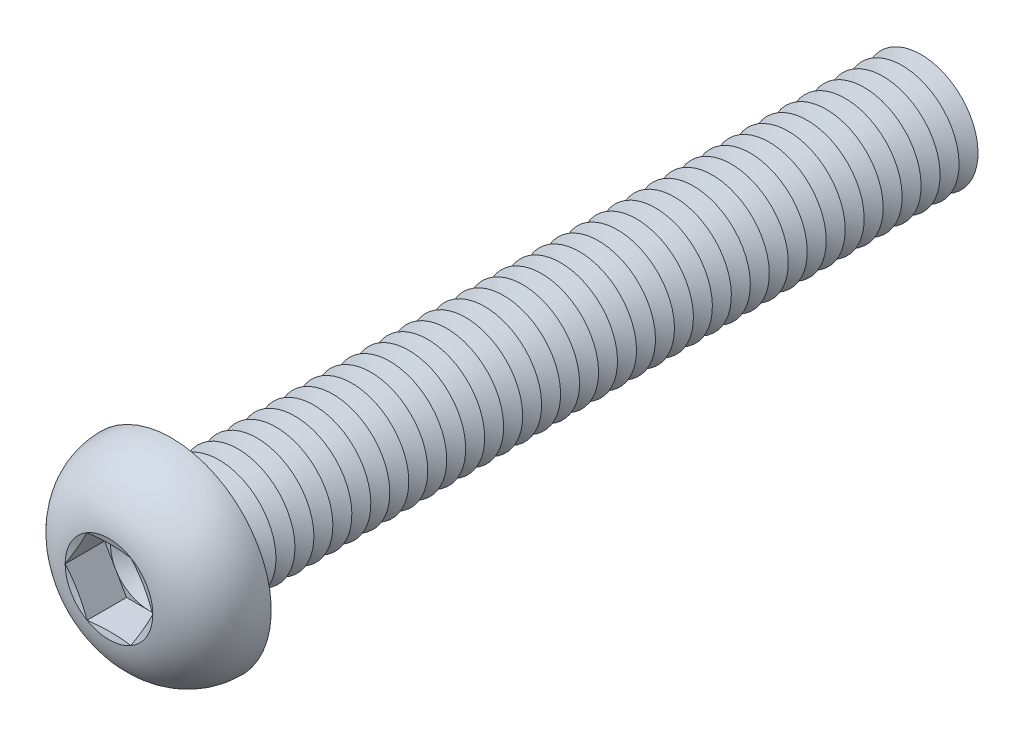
ISO-10303-21;
HEADER;
FILE_DESCRIPTION(('STEP AP214'),'2;1');
FILE_NAME('part.step','',(''),(''),'','','');
FILE_SCHEMA(('AUTOMOTIVE_DESIGN { 1 0 10303 214 1 1 1 1 }'));
ENDSEC;
DATA;
#1=APPLICATION_CONTEXT('core data for automotive mechanical design processes');
#2=APPLICATION_PROTOCOL_DEFINITION('international standard','automotive_design',2000,#1);
#3=PRODUCT_CONTEXT('',#1,'mechanical');
#4=PRODUCT('Part','Part','',(#3));
#5=PRODUCT_RELATED_PRODUCT_CATEGORY('part','',(#4));
#6=PRODUCT_DEFINITION_FORMATION('','',#4);
#7=PRODUCT_DEFINITION_CONTEXT('part definition',#1,'design');
#8=PRODUCT_DEFINITION('design','',#6,#7);
#9=PRODUCT_DEFINITION_SHAPE('','',#8);
#10=(LENGTH_UNIT() NAMED_UNIT(*) SI_UNIT(.MILLI.,.METRE.));
#11=(NAMED_UNIT(*) PLANE_ANGLE_UNIT() SI_UNIT($,.RADIAN.));
#12=(NAMED_UNIT(*) SI_UNIT($,.STERADIAN.) SOLID_ANGLE_UNIT());
#13=UNCERTAINTY_MEASURE_WITH_UNIT(LENGTH_MEASURE(1.E-05),#10,'distance_accuracy_value','');
#14=(GEOMETRIC_REPRESENTATION_CONTEXT(3) GLOBAL_UNCERTAINTY_ASSIGNED_CONTEXT((#13)) GLOBAL_UNIT_ASSIGNED_CONTEXT((#10,
#11,#12)) REPRESENTATION_CONTEXT('',''));
#15=CARTESIAN_POINT('',(0.,0.,0.));
#16=DIRECTION('',(0.,0.,1.));
#17=DIRECTION('',(1.,0.,0.));
#18=AXIS2_PLACEMENT_3D('',#15,#16,#17);
#19=CARTESIAN_POINT('',(0.,0.,1.22));
#20=DIRECTION('',(0.,0.,1.));
#21=DIRECTION('',(1.,0.,0.));
#22=AXIS2_PLACEMENT_3D('',#19,#20,#21);
#23=PLANE('',#22);
#24=CARTESIAN_POINT('',(0.,0.,1.22));
#25=DIRECTION('',(0.,0.,1.));
#26=DIRECTION('',(1.,0.,0.));
#27=AXIS2_PLACEMENT_3D('',#24,#25,#26);
#28=CIRCLE('',#27,1.99999906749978);
#29=CARTESIAN_POINT('',(1.73205,0.999999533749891,1.22));
#30=VERTEX_POINT('',#29);
#31=CARTESIAN_POINT('',(0.,1.99999906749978,1.22));
#32=VERTEX_POINT('',#31);
#33=EDGE_CURVE('E118',#30,#32,#28,.T.);
#34=ORIENTED_EDGE('',*,*,#33,.F.);
#35=DIRECTION('',(-0.5,0.866025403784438,0.));
#36=VECTOR('',#35,1.);
#37=CARTESIAN_POINT('',(2.3094,0.,1.22));
#38=LINE('',#37,#36);
#39=CARTESIAN_POINT('',(1.1547,1.99999906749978,1.22));
#40=VERTEX_POINT('',#39);
#41=EDGE_CURVE('E125',#30,#40,#38,.T.);
#42=ORIENTED_EDGE('',*,*,#41,.T.);
#43=DIRECTION('',(-1.,0.,0.));
#44=VECTOR('',#43,1.);
#45=CARTESIAN_POINT('',(1.1547,1.99999906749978,1.22));
#46=LINE('',#45,#44);
#47=EDGE_CURVE('E136',#40,#32,#46,.T.);
#48=ORIENTED_EDGE('',*,*,#47,.T.);
#49=EDGE_LOOP('',(#34,#42,#48));
#50=FACE_BOUND('',#49,.T.);
#51=ADVANCED_FACE('F39',(#50),#23,.T.);
#52=CARTESIAN_POINT('',(0.,0.,1.22));
#53=DIRECTION('',(0.,0.,1.));
#54=DIRECTION('',(1.,0.,0.));
#55=AXIS2_PLACEMENT_3D('',#52,#53,#54);
#56=CIRCLE('',#55,1.99999906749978);
#57=CARTESIAN_POINT('',(-1.73205,0.999999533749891,1.22));
#58=VERTEX_POINT('',#57);
#59=EDGE_CURVE('E11',#32,#58,#56,.T.);
#60=ORIENTED_EDGE('',*,*,#59,.F.);
#61=CARTESIAN_POINT('',(-1.1547,1.99999906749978,1.22));
#62=VERTEX_POINT('',#61);
#63=EDGE_CURVE('E131',#32,#62,#46,.T.);
#64=ORIENTED_EDGE('',*,*,#63,.T.);
#65=DIRECTION('',(-0.5,-0.866025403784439,0.));
#66=VECTOR('',#65,1.);
#67=CARTESIAN_POINT('',(-1.1547,1.99999906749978,1.22));
#68=LINE('',#67,#66);
#69=EDGE_CURVE('E134',#62,#58,#68,.T.);
#70=ORIENTED_EDGE('',*,*,#69,.T.);
#71=EDGE_LOOP('',(#60,#64,#70));
#72=FACE_BOUND('',#71,.T.);
#73=ADVANCED_FACE('F130',(#72),#23,.T.);
#74=CARTESIAN_POINT('',(-1.73205,-0.999999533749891,1.22));
#75=VERTEX_POINT('',#74);
#76=EDGE_CURVE('E49',#58,#75,#56,.T.);
#77=ORIENTED_EDGE('',*,*,#76,.F.);
#78=CARTESIAN_POINT('',(-2.3094,0.,1.22));
#79=VERTEX_POINT('',#78);
#80=EDGE_CURVE('E143',#58,#79,#68,.T.);
#81=ORIENTED_EDGE('',*,*,#80,.T.);
#82=DIRECTION('',(0.5,-0.866025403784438,0.));
#83=VECTOR('',#82,1.);
#84=CARTESIAN_POINT('',(-2.3094,0.,1.22));
#85=LINE('',#84,#83);
#86=EDGE_CURVE('E152',#79,#75,#85,.T.);
#87=ORIENTED_EDGE('',*,*,#86,.T.);
#88=EDGE_LOOP('',(#77,#81,#87));
#89=FACE_BOUND('',#88,.T.);
#90=ADVANCED_FACE('F588',(#89),#23,.T.);
#91=CARTESIAN_POINT('',(0.,-1.99999906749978,1.22));
#92=VERTEX_POINT('',#91);
#93=EDGE_CURVE('E572',#75,#92,#56,.T.);
#94=ORIENTED_EDGE('',*,*,#93,.F.);
#95=CARTESIAN_POINT('',(-1.1547,-1.99999906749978,1.22));
#96=VERTEX_POINT('',#95);
#97=EDGE_CURVE('E151',#75,#96,#85,.T.);
#98=ORIENTED_EDGE('',*,*,#97,.T.);
#99=DIRECTION('',(1.,0.,0.));
#100=VECTOR('',#99,1.);
#101=CARTESIAN_POINT('',(-1.1547,-1.99999906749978,1.22));
#102=LINE('',#101,#100);
#103=EDGE_CURVE('E157',#96,#92,#102,.T.);
#104=ORIENTED_EDGE('',*,*,#103,.T.);
#105=EDGE_LOOP('',(#94,#98,#104));
#106=FACE_BOUND('',#105,.T.);
#107=ADVANCED_FACE('F581',(#106),#23,.T.);
#108=CARTESIAN_POINT('',(1.73205,-0.999999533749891,1.22));
#109=VERTEX_POINT('',#108);
#110=EDGE_CURVE('E56',#92,#109,#56,.T.);
#111=ORIENTED_EDGE('',*,*,#110,.F.);
#112=CARTESIAN_POINT('',(1.1547,-1.99999906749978,1.22));
#113=VERTEX_POINT('',#112);
#114=EDGE_CURVE('E156',#92,#113,#102,.T.);
#115=ORIENTED_EDGE('',*,*,#114,.T.);
#116=DIRECTION('',(0.5,0.866025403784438,0.));
#117=VECTOR('',#116,1.);
#118=CARTESIAN_POINT('',(1.1547,-1.99999906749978,1.22));
#119=LINE('',#118,#117);
#120=EDGE_CURVE('E162',#113,#109,#119,.T.);
#121=ORIENTED_EDGE('',*,*,#120,.T.);
#122=EDGE_LOOP('',(#111,#115,#121));
#123=FACE_BOUND('',#122,.T.);
#124=ADVANCED_FACE('F658',(#123),#23,.T.);
#125=CARTESIAN_POINT('',(0.,0.,3.3));
#126=DIRECTION('',(0.,0.,1.));
#127=DIRECTION('',(0.,-1.,0.));
#128=AXIS2_PLACEMENT_3D('',#125,#126,#127);
#129=CONICAL_SURFACE('',#128,2.3094,1.30899693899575);
#130=CARTESIAN_POINT('',(2.30951547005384,-0.000200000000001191,3.30003094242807));
#131=CARTESIAN_POINT('',(2.26155412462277,0.0828714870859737,3.2871729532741));
#132=CARTESIAN_POINT('',(2.21350580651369,0.166093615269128,3.27549992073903));
#133=CARTESIAN_POINT('',(2.11723944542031,0.332831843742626,3.2549913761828));
#134=CARTESIAN_POINT('',(2.06902134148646,0.416348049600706,3.24615701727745));
#135=CARTESIAN_POINT('',(1.97270782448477,0.583167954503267,3.23184167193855));
#136=CARTESIAN_POINT('',(1.92461306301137,0.666470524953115,3.22634360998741));
#137=CARTESIAN_POINT('',(1.82836219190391,0.833181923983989,3.21897125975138));
#138=CARTESIAN_POINT('',(1.78020609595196,0.916590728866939,3.21709626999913));
#139=CARTESIAN_POINT('',(1.68389390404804,1.08340833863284,3.21709626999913));
#140=CARTESIAN_POINT('',(1.63573780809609,1.16681714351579,3.21897125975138));
#141=CARTESIAN_POINT('',(1.53948693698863,1.33352854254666,3.22634360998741));
#142=CARTESIAN_POINT('',(1.49139217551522,1.41683111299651,3.23184167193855));
#143=CARTESIAN_POINT('',(1.39507865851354,1.58365101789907,3.24615701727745));
#144=CARTESIAN_POINT('',(1.34686055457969,1.66716722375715,3.2549913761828));
#145=CARTESIAN_POINT('',(1.25059419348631,1.83390545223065,3.27549992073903));
#146=CARTESIAN_POINT('',(1.20254587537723,1.9171275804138,3.2871729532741));
#147=CARTESIAN_POINT('',(1.15458452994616,2.00019906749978,3.30003094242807));
#148=B_SPLINE_CURVE_WITH_KNOTS('',3,(#130,#131,#132,#133,#134,#135,#136,#137,#138,#139,#140,
#141,#142,#143,#144,#145,#146,#147),.UNSPECIFIED.,.F.,.F.,(4,2,2,2,2,2,2,2,4),(0.,
0.290357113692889,0.580832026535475,0.869807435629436,1.15872689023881,1.44764634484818,
1.73662175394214,2.02709666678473,2.31745378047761),.UNSPECIFIED.);
#149=CARTESIAN_POINT('',(2.3094,0.,3.3));
#150=VERTEX_POINT('',#149);
#151=CARTESIAN_POINT('',(1.15469999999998,1.99999906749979,3.3));
#152=VERTEX_POINT('',#151);
#153=EDGE_CURVE('E219',#150,#152,#148,.T.);
#154=ORIENTED_EDGE('',*,*,#153,.F.);
#155=CARTESIAN_POINT('',(0.,0.,3.3));
#156=DIRECTION('',(0.,0.,-1.));
#157=DIRECTION('',(0.,1.,0.));
#158=AXIS2_PLACEMENT_3D('',#155,#156,#157);
#159=CIRCLE('',#158,2.3094);
#160=EDGE_CURVE('E555',#152,#150,#159,.T.);
#161=ORIENTED_EDGE('',*,*,#160,.F.);
#162=EDGE_LOOP('',(#154,#161));
#163=FACE_BOUND('',#162,.T.);
#164=ADVANCED_FACE('F662',(#163),#129,.F.);
#165=CARTESIAN_POINT('',(1.15458452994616,-2.00019906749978,3.30003094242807));
#166=CARTESIAN_POINT('',(1.20254587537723,-1.91712758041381,3.2871729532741));
#167=CARTESIAN_POINT('',(1.25059419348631,-1.83390545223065,3.27549992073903));
#168=CARTESIAN_POINT('',(1.34686055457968,-1.66716722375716,3.2549913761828));
#169=CARTESIAN_POINT('',(1.39507865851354,-1.58365101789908,3.24615701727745));
#170=CARTESIAN_POINT('',(1.49139217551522,-1.41683111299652,3.23184167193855));
#171=CARTESIAN_POINT('',(1.53948693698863,-1.33352854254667,3.22634360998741));
#172=CARTESIAN_POINT('',(1.63573780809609,-1.16681714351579,3.21897125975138));
#173=CARTESIAN_POINT('',(1.68389390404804,-1.08340833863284,3.21709626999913));
#174=CARTESIAN_POINT('',(1.78020609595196,-0.916590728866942,3.21709626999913));
#175=CARTESIAN_POINT('',(1.82836219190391,-0.833181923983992,3.21897125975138));
#176=CARTESIAN_POINT('',(1.92461306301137,-0.666470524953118,3.22634360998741));
#177=CARTESIAN_POINT('',(1.97270782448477,-0.58316795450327,3.23184167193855));
#178=CARTESIAN_POINT('',(2.06902134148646,-0.416348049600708,3.24615701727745));
#179=CARTESIAN_POINT('',(2.11723944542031,-0.332831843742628,3.2549913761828));
#180=CARTESIAN_POINT('',(2.21350580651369,-0.16609361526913,3.27549992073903));
#181=CARTESIAN_POINT('',(2.26155412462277,-0.0828714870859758,3.2871729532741));
#182=CARTESIAN_POINT('',(2.30951547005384,0.000199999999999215,3.30003094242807));
#183=B_SPLINE_CURVE_WITH_KNOTS('',3,(#165,#166,#167,#168,#169,#170,#171,#172,#173,#174,#175,
#176,#177,#178,#179,#180,#181,#182),.UNSPECIFIED.,.F.,.F.,(4,2,2,2,2,2,2,2,4),(0.,
0.290357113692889,0.580832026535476,0.869807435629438,1.15872689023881,1.44764634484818,
1.73662175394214,2.02709666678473,2.31745378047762),.UNSPECIFIED.);
#184=CARTESIAN_POINT('',(1.1547,-1.99999906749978,3.3));
#185=VERTEX_POINT('',#184);
#186=EDGE_CURVE('E228',#185,#150,#183,.T.);
#187=ORIENTED_EDGE('',*,*,#186,.F.);
#188=EDGE_CURVE('E560',#150,#185,#159,.T.);
#189=ORIENTED_EDGE('',*,*,#188,.F.);
#190=EDGE_LOOP('',(#187,#189));
#191=FACE_BOUND('',#190,.T.);
#192=ADVANCED_FACE('F623',(#191),#129,.F.);
#193=CARTESIAN_POINT('',(-3.4849337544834,-1.99999906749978,3.75783251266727));
#194=CARTESIAN_POINT('',(-3.40057136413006,-1.99999906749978,3.73822859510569));
#195=CARTESIAN_POINT('',(-3.31617090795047,-1.99999906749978,3.71878852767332));
#196=CARTESIAN_POINT('',(-3.14727791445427,-1.99999906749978,3.68030638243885));
#197=CARTESIAN_POINT('',(-3.06278537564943,-1.99999906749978,3.66126431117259));
#198=CARTESIAN_POINT('',(-2.80911712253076,-1.99999906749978,3.60483420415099));
#199=CARTESIAN_POINT('',(-2.63978343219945,-1.99999906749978,3.5681499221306));
#200=CARTESIAN_POINT('',(-2.29895421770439,-1.99999906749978,3.49717072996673));
#201=CARTESIAN_POINT('',(-2.12745330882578,-1.99999906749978,3.4629014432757));
#202=CARTESIAN_POINT('',(-1.78364663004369,-1.99999906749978,3.39849485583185));
#203=CARTESIAN_POINT('',(-1.61134079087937,-1.99999906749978,3.36835791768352));
#204=CARTESIAN_POINT('',(-1.27040784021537,-1.99999906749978,3.31501553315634));
#205=CARTESIAN_POINT('',(-1.10180724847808,-1.99999906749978,3.291644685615));
#206=CARTESIAN_POINT('',(-0.763641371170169,-1.99999906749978,3.2533727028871));
#207=CARTESIAN_POINT('',(-0.594076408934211,-1.99999906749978,3.23846888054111));
#208=CARTESIAN_POINT('',(-0.339649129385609,-1.99999906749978,3.22431372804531));
#209=CARTESIAN_POINT('',(-0.255009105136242,-1.99999906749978,3.22096057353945));
#210=CARTESIAN_POINT('',(-0.0856618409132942,-1.99999906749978,3.21711210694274));
#211=CARTESIAN_POINT('',(-0.000954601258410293,-1.99999906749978,3.2166167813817));
#212=CARTESIAN_POINT('',(0.16843098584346,-1.99999906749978,3.21851478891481));
#213=CARTESIAN_POINT('',(0.253109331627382,-1.99999906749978,3.2209082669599));
#214=CARTESIAN_POINT('',(0.422344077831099,-1.99999906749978,3.22845792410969));
#215=CARTESIAN_POINT('',(0.506900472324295,-1.99999906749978,3.23361423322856));
#216=CARTESIAN_POINT('',(0.712240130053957,-1.99999906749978,3.24921577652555));
#217=CARTESIAN_POINT('',(0.832922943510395,-1.99999906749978,3.26098285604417));
#218=CARTESIAN_POINT('',(1.07378161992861,-1.99999906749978,3.28874908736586));
#219=CARTESIAN_POINT('',(1.1939575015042,-1.99999906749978,3.30474808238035));
#220=CARTESIAN_POINT('',(1.43419655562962,-1.99999906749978,3.34009172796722));
#221=CARTESIAN_POINT('',(1.55425817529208,-1.99999906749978,3.35944677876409));
#222=CARTESIAN_POINT('',(1.79394991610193,-1.99999906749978,3.40067076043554));
#223=CARTESIAN_POINT('',(1.91358001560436,-1.99999906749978,3.42253981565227));
#224=CARTESIAN_POINT('',(2.15493405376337,-1.99999906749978,3.46864194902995));
#225=CARTESIAN_POINT('',(2.27665041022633,-1.99999906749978,3.49291441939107));
#226=CARTESIAN_POINT('',(2.51977680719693,-1.99999906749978,3.54294628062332));
#227=CARTESIAN_POINT('',(2.64118684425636,-1.99999906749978,3.56870568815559));
#228=CARTESIAN_POINT('',(2.88310060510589,-1.99999906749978,3.62120891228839));
#229=CARTESIAN_POINT('',(3.00360566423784,-1.99999906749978,3.6479466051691));
#230=CARTESIAN_POINT('',(3.24441021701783,-1.99999906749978,3.7022947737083));
#231=CARTESIAN_POINT('',(3.36470972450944,-1.99999906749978,3.72990518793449));
#232=CARTESIAN_POINT('',(3.4849337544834,-1.99999906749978,3.75783251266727));
#233=B_SPLINE_CURVE_WITH_KNOTS('',3,(#193,#194,#195,#196,#197,#198,#199,#200,#201,#202,#203,
#204,#205,#206,#207,#208,#209,#210,#211,#212,#213,#214,#215,#216,#217,#218,#219,#220,#221,#222,
#223,#224,#225,#226,#227,#228,#229,#230,#231,#232),.UNSPECIFIED.,.F.,.F.,(4,2,2,2,2,2,2,2,2,2,2,
2,2,2,2,2,2,2,2,4),(0.,0.259830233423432,0.519664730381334,1.03943435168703,1.56407662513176,
2.08876490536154,2.59926476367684,3.10960251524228,3.36367930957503,3.61775490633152,
3.87184325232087,4.1259435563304,4.48960924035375,4.85326145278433,5.21806142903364,
5.58287945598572,5.95520617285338,6.32753706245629,6.69784064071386,7.06811821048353),.UNSPECIFIED.);
#234=CARTESIAN_POINT('',(-1.1547,-1.99999906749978,3.3));
#235=VERTEX_POINT('',#234);
#236=EDGE_CURVE('E602',#235,#185,#233,.T.);
#237=ORIENTED_EDGE('',*,*,#236,.F.);
#238=EDGE_CURVE('E615',#185,#235,#159,.T.);
#239=ORIENTED_EDGE('',*,*,#238,.F.);
#240=EDGE_LOOP('',(#237,#239));
#241=FACE_BOUND('',#240,.T.);
#242=ADVANCED_FACE('F629',(#241),#129,.F.);
#243=CARTESIAN_POINT('',(-2.30951547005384,0.000199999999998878,3.30003094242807));
#244=CARTESIAN_POINT('',(-2.26155412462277,-0.0828714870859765,3.2871729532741));
#245=CARTESIAN_POINT('',(-2.21350580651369,-0.166093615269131,3.27549992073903));
#246=CARTESIAN_POINT('',(-2.11723944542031,-0.332831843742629,3.2549913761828));
#247=CARTESIAN_POINT('',(-2.06902134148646,-0.416348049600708,3.24615701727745));
#248=CARTESIAN_POINT('',(-1.97270782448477,-0.58316795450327,3.23184167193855));
#249=CARTESIAN_POINT('',(-1.92461306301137,-0.666470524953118,3.22634360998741));
#250=CARTESIAN_POINT('',(-1.82836219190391,-0.833181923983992,3.21897125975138));
#251=CARTESIAN_POINT('',(-1.78020609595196,-0.916590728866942,3.21709626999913));
#252=CARTESIAN_POINT('',(-1.68389390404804,-1.08340833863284,3.21709626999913));
#253=CARTESIAN_POINT('',(-1.63573780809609,-1.16681714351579,3.21897125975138));
#254=CARTESIAN_POINT('',(-1.53948693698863,-1.33352854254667,3.22634360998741));
#255=CARTESIAN_POINT('',(-1.49139217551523,-1.41683111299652,3.23184167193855));
#256=CARTESIAN_POINT('',(-1.39507865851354,-1.58365101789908,3.24615701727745));
#257=CARTESIAN_POINT('',(-1.34686055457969,-1.66716722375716,3.2549913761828));
#258=CARTESIAN_POINT('',(-1.25059419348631,-1.83390545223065,3.27549992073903));
#259=CARTESIAN_POINT('',(-1.20254587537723,-1.91712758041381,3.2871729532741));
#260=CARTESIAN_POINT('',(-1.15458452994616,-2.00019906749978,3.30003094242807));
#261=B_SPLINE_CURVE_WITH_KNOTS('',3,(#243,#244,#245,#246,#247,#248,#249,#250,#251,#252,#253,
#254,#255,#256,#257,#258,#259,#260),.UNSPECIFIED.,.F.,.F.,(4,2,2,2,2,2,2,2,4),(0.,
0.290357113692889,0.580832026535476,0.869807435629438,1.15872689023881,1.44764634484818,
1.73662175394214,2.02709666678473,2.31745378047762),.UNSPECIFIED.);
#262=CARTESIAN_POINT('',(-2.3094,0.,3.3));
#263=VERTEX_POINT('',#262);
#264=EDGE_CURVE('E593',#263,#235,#261,.T.);
#265=ORIENTED_EDGE('',*,*,#264,.F.);
#266=EDGE_CURVE('E599',#235,#263,#159,.T.);
#267=ORIENTED_EDGE('',*,*,#266,.F.);
#268=EDGE_LOOP('',(#265,#267));
#269=FACE_BOUND('',#268,.T.);
#270=ADVANCED_FACE('F597',(#269),#129,.F.);
#271=CARTESIAN_POINT('',(-1.15458452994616,2.00019906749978,3.30003094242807));
#272=CARTESIAN_POINT('',(-1.20254587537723,1.9171275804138,3.2871729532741));
#273=CARTESIAN_POINT('',(-1.25059419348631,1.83390545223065,3.27549992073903));
#274=CARTESIAN_POINT('',(-1.34686055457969,1.66716722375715,3.2549913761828));
#275=CARTESIAN_POINT('',(-1.39507865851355,1.58365101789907,3.24615701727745));
#276=CARTESIAN_POINT('',(-1.49139217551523,1.41683111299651,3.23184167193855));
#277=CARTESIAN_POINT('',(-1.53948693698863,1.33352854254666,3.22634360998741));
#278=CARTESIAN_POINT('',(-1.63573780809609,1.16681714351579,3.21897125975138));
#279=CARTESIAN_POINT('',(-1.68389390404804,1.08340833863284,3.21709626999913));
#280=CARTESIAN_POINT('',(-1.78020609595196,0.916590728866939,3.21709626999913));
#281=CARTESIAN_POINT('',(-1.82836219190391,0.833181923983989,3.21897125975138));
#282=CARTESIAN_POINT('',(-1.92461306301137,0.666470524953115,3.22634360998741));
#283=CARTESIAN_POINT('',(-1.97270782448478,0.583167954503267,3.23184167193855));
#284=CARTESIAN_POINT('',(-2.06902134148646,0.416348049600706,3.24615701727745));
#285=CARTESIAN_POINT('',(-2.11723944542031,0.332831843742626,3.2549913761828));
#286=CARTESIAN_POINT('',(-2.21350580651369,0.166093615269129,3.27549992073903));
#287=CARTESIAN_POINT('',(-2.26155412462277,0.0828714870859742,3.2871729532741));
#288=CARTESIAN_POINT('',(-2.30951547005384,-0.000200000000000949,3.30003094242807));
#289=B_SPLINE_CURVE_WITH_KNOTS('',3,(#271,#272,#273,#274,#275,#276,#277,#278,#279,#280,#281,
#282,#283,#284,#285,#286,#287,#288),.UNSPECIFIED.,.F.,.F.,(4,2,2,2,2,2,2,2,4),(0.,
0.290357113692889,0.580832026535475,0.869807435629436,1.15872689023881,1.44764634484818,
1.73662175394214,2.02709666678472,2.31745378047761),.UNSPECIFIED.);
#290=CARTESIAN_POINT('',(-1.1547,1.99999906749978,3.3));
#291=VERTEX_POINT('',#290);
#292=EDGE_CURVE('E193',#291,#263,#289,.T.);
#293=ORIENTED_EDGE('',*,*,#292,.F.);
#294=EDGE_CURVE('E605',#263,#291,#159,.T.);
#295=ORIENTED_EDGE('',*,*,#294,.F.);
#296=EDGE_LOOP('',(#293,#295));
#297=FACE_BOUND('',#296,.T.);
#298=ADVANCED_FACE('F606',(#297),#129,.F.);
#299=CARTESIAN_POINT('',(0.,0.,-36.5));
#300=DIRECTION('',(0.,0.,1.));
#301=DIRECTION('',(0.,-1.,0.));
#302=AXIS2_PLACEMENT_3D('',#299,#300,#301);
#303=CONICAL_SURFACE('',#302,2.99999999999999,1.0471975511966);
#304=CARTESIAN_POINT('',(0.,0.,-37.));
#305=DIRECTION('',(0.,0.,1.));
#306=DIRECTION('',(0.,-1.,0.));
#307=AXIS2_PLACEMENT_3D('',#304,#305,#306);
#308=CIRCLE('',#307,2.13397459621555);
#309=CARTESIAN_POINT('',(0.,-2.13397459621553,-37.));
#310=VERTEX_POINT('',#309);
#311=EDGE_CURVE('E526',#310,#310,#308,.T.);
#312=ORIENTED_EDGE('',*,*,#311,.T.);
#313=EDGE_LOOP('',(#312));
#314=FACE_BOUND('',#313,.T.);
#315=CARTESIAN_POINT('',(0.,0.,-36.5));
#316=DIRECTION('',(0.,0.,1.));
#317=DIRECTION('',(0.,-1.,0.));
#318=AXIS2_PLACEMENT_3D('',#315,#316,#317);
#319=CIRCLE('',#318,2.99999999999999);
#320=CARTESIAN_POINT('',(0.,-2.99999999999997,-36.5));
#321=VERTEX_POINT('',#320);
#322=EDGE_CURVE('E522',#321,#321,#319,.T.);
#323=ORIENTED_EDGE('',*,*,#322,.F.);
#324=EDGE_LOOP('',(#323));
#325=FACE_BOUND('',#324,.T.);
#326=ADVANCED_FACE('F688',(#314,#325),#303,.T.);
#327=CARTESIAN_POINT('',(0.,0.,-37.));
#328=DIRECTION('',(0.,0.,-1.));
#329=DIRECTION('',(0.,1.,0.));
#330=AXIS2_PLACEMENT_3D('',#327,#328,#329);
#331=CONICAL_SURFACE('',#330,2.13397459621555,1.0471975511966);
#332=CARTESIAN_POINT('',(0.,0.,-37.5));
#333=DIRECTION('',(0.,0.,1.));
#334=DIRECTION('',(0.,-1.,0.));
#335=AXIS2_PLACEMENT_3D('',#332,#333,#334);
#336=CIRCLE('',#335,2.99999999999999);
#337=CARTESIAN_POINT('',(0.,-2.99999999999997,-37.5));
#338=VERTEX_POINT('',#337);
#339=EDGE_CURVE('E530',#338,#338,#336,.T.);
#340=ORIENTED_EDGE('',*,*,#339,.T.);
#341=EDGE_LOOP('',(#340));
#342=FACE_BOUND('',#341,.T.);
#343=ORIENTED_EDGE('',*,*,#311,.F.);
#344=EDGE_LOOP('',(#343));
#345=FACE_BOUND('',#344,.T.);
#346=ADVANCED_FACE('F693',(#342,#345),#331,.T.);
#347=CARTESIAN_POINT('',(0.,3.,-40.));
#348=DIRECTION('',(0.,0.,-1.));
#349=DIRECTION('',(0.,1.,0.));
#350=AXIS2_PLACEMENT_3D('',#347,#348,#349);
#351=PLANE('',#350);
#352=CARTESIAN_POINT('',(0.,0.,-40.));
#353=DIRECTION('',(0.,0.,1.));
#354=DIRECTION('',(0.,-1.,0.));
#355=AXIS2_PLACEMENT_3D('',#352,#353,#354);
#356=CIRCLE('',#355,2.13397459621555);
#357=CARTESIAN_POINT('',(0.,-2.13397459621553,-40.));
#358=VERTEX_POINT('',#357);
#359=EDGE_CURVE('E550',#358,#358,#356,.T.);
#360=ORIENTED_EDGE('',*,*,#359,.F.);
#361=EDGE_LOOP('',(#360));
#362=FACE_BOUND('',#361,.T.);
#363=ADVANCED_FACE('F860',(#362),#351,.T.);
#364=CARTESIAN_POINT('',(0.,0.,-39.5));
#365=DIRECTION('',(0.,0.,1.));
#366=DIRECTION('',(0.,-1.,0.));
#367=AXIS2_PLACEMENT_3D('',#364,#365,#366);
#368=CONICAL_SURFACE('',#367,2.99999999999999,1.0471975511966);
#369=ORIENTED_EDGE('',*,*,#359,.T.);
#370=EDGE_LOOP('',(#369));
#371=FACE_BOUND('',#370,.T.);
#372=CARTESIAN_POINT('',(0.,0.,-39.5));
#373=DIRECTION('',(0.,0.,1.));
#374=DIRECTION('',(0.,-1.,0.));
#375=AXIS2_PLACEMENT_3D('',#372,#373,#374);
#376=CIRCLE('',#375,2.99999999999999);
#377=CARTESIAN_POINT('',(0.,-2.99999999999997,-39.5));
#378=VERTEX_POINT('',#377);
#379=EDGE_CURVE('E546',#378,#378,#376,.T.);
#380=ORIENTED_EDGE('',*,*,#379,.F.);
#381=EDGE_LOOP('',(#380));
#382=FACE_BOUND('',#381,.T.);
#383=ADVANCED_FACE('F853',(#371,#382),#368,.T.);
#384=CARTESIAN_POINT('',(0.,0.,-39.));
#385=DIRECTION('',(0.,0.,-1.));
#386=DIRECTION('',(0.,1.,0.));
#387=AXIS2_PLACEMENT_3D('',#384,#385,#386);
#388=CONICAL_SURFACE('',#387,2.13397459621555,1.0471975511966);
#389=ORIENTED_EDGE('',*,*,#379,.T.);
#390=EDGE_LOOP('',(#389));
#391=FACE_BOUND('',#390,.T.);
#392=CARTESIAN_POINT('',(0.,0.,-39.));
#393=DIRECTION('',(0.,0.,1.));
#394=DIRECTION('',(0.,-1.,0.));
#395=AXIS2_PLACEMENT_3D('',#392,#393,#394);
#396=CIRCLE('',#395,2.13397459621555);
#397=CARTESIAN_POINT('',(0.,-2.13397459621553,-39.));
#398=VERTEX_POINT('',#397);
#399=EDGE_CURVE('E542',#398,#398,#396,.T.);
#400=ORIENTED_EDGE('',*,*,#399,.F.);
#401=EDGE_LOOP('',(#400));
#402=FACE_BOUND('',#401,.T.);
#403=ADVANCED_FACE('F859',(#391,#402),#388,.T.);
#404=CARTESIAN_POINT('',(0.,0.,-38.5));
#405=DIRECTION('',(0.,0.,1.));
#406=DIRECTION('',(0.,-1.,0.));
#407=AXIS2_PLACEMENT_3D('',#404,#405,#406);
#408=CONICAL_SURFACE('',#407,2.99999999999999,1.0471975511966);
#409=ORIENTED_EDGE('',*,*,#399,.T.);
#410=EDGE_LOOP('',(#409));
#411=FACE_BOUND('',#410,.T.);
#412=CARTESIAN_POINT('',(0.,0.,-38.5));
#413=DIRECTION('',(0.,0.,1.));
#414=DIRECTION('',(0.,-1.,0.));
#415=AXIS2_PLACEMENT_3D('',#412,#413,#414);
#416=CIRCLE('',#415,2.99999999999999);
#417=CARTESIAN_POINT('',(0.,-2.99999999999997,-38.5));
#418=VERTEX_POINT('',#417);
#419=EDGE_CURVE('E538',#418,#418,#416,.T.);
#420=ORIENTED_EDGE('',*,*,#419,.F.);
#421=EDGE_LOOP('',(#420));
#422=FACE_BOUND('',#421,.T.);
#423=ADVANCED_FACE('F891',(#411,#422),#408,.T.);
#424=CARTESIAN_POINT('',(0.,0.,-38.));
#425=DIRECTION('',(0.,0.,-1.));
#426=DIRECTION('',(0.,1.,0.));
#427=AXIS2_PLACEMENT_3D('',#424,#425,#426);
#428=CONICAL_SURFACE('',#427,2.13397459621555,1.0471975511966);
#429=ORIENTED_EDGE('',*,*,#419,.T.);
#430=EDGE_LOOP('',(#429));
#431=FACE_BOUND('',#430,.T.);
#432=CARTESIAN_POINT('',(0.,0.,-38.));
#433=DIRECTION('',(0.,0.,1.));
#434=DIRECTION('',(0.,-1.,0.));
#435=AXIS2_PLACEMENT_3D('',#432,#433,#434);
#436=CIRCLE('',#435,2.13397459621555);
#437=CARTESIAN_POINT('',(0.,-2.13397459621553,-38.));
#438=VERTEX_POINT('',#437);
#439=EDGE_CURVE('E534',#438,#438,#436,.T.);
#440=ORIENTED_EDGE('',*,*,#439,.F.);
#441=EDGE_LOOP('',(#440));
#442=FACE_BOUND('',#441,.T.);
#443=ADVANCED_FACE('F901',(#431,#442),#428,.T.);
#444=CARTESIAN_POINT('',(0.,0.,-37.5));
#445=DIRECTION('',(0.,0.,1.));
#446=DIRECTION('',(0.,-1.,0.));
#447=AXIS2_PLACEMENT_3D('',#444,#445,#446);
#448=CONICAL_SURFACE('',#447,2.99999999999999,1.0471975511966);
#449=ORIENTED_EDGE('',*,*,#439,.T.);
#450=EDGE_LOOP('',(#449));
#451=FACE_BOUND('',#450,.T.);
#452=ORIENTED_EDGE('',*,*,#339,.F.);
#453=EDGE_LOOP('',(#452));
#454=FACE_BOUND('',#453,.T.);
#455=ADVANCED_FACE('F911',(#451,#454),#448,.T.);
#456=CARTESIAN_POINT('',(0.,0.,-35.5));
#457=DIRECTION('',(0.,0.,1.));
#458=DIRECTION('',(0.,-1.,0.));
#459=AXIS2_PLACEMENT_3D('',#456,#457,#458);
#460=CONICAL_SURFACE('',#459,2.99999999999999,1.0471975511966);
#461=CARTESIAN_POINT('',(0.,0.,-36.));
#462=DIRECTION('',(0.,0.,1.));
#463=DIRECTION('',(0.,-1.,0.));
#464=AXIS2_PLACEMENT_3D('',#461,#462,#463);
#465=CIRCLE('',#464,2.13397459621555);
#466=CARTESIAN_POINT('',(0.,-2.13397459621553,-36.));
#467=VERTEX_POINT('',#466);
#468=EDGE_CURVE('E518',#467,#467,#465,.T.);
#469=ORIENTED_EDGE('',*,*,#468,.T.);
#470=EDGE_LOOP('',(#469));
#471=FACE_BOUND('',#470,.T.);
#472=CARTESIAN_POINT('',(0.,0.,-35.5));
#473=DIRECTION('',(0.,0.,1.));
#474=DIRECTION('',(0.,-1.,0.));
#475=AXIS2_PLACEMENT_3D('',#472,#473,#474);
#476=CIRCLE('',#475,2.99999999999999);
#477=CARTESIAN_POINT('',(0.,-2.99999999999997,-35.5));
#478=VERTEX_POINT('',#477);
#479=EDGE_CURVE('E514',#478,#478,#476,.T.);
#480=ORIENTED_EDGE('',*,*,#479,.F.);
#481=EDGE_LOOP('',(#480));
#482=FACE_BOUND('',#481,.T.);
#483=ADVANCED_FACE('F921',(#471,#482),#460,.T.);
#484=CARTESIAN_POINT('',(0.,0.,-36.));
#485=DIRECTION('',(0.,0.,-1.));
#486=DIRECTION('',(0.,1.,0.));
#487=AXIS2_PLACEMENT_3D('',#484,#485,#486);
#488=CONICAL_SURFACE('',#487,2.13397459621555,1.0471975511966);
#489=ORIENTED_EDGE('',*,*,#322,.T.);
#490=EDGE_LOOP('',(#489));
#491=FACE_BOUND('',#490,.T.);
#492=ORIENTED_EDGE('',*,*,#468,.F.);
#493=EDGE_LOOP('',(#492));
#494=FACE_BOUND('',#493,.T.);
#495=ADVANCED_FACE('F931',(#491,#494),#488,.T.);
#496=CARTESIAN_POINT('',(0.,0.,-34.5));
#497=DIRECTION('',(0.,0.,1.));
#498=DIRECTION('',(0.,-1.,0.));
#499=AXIS2_PLACEMENT_3D('',#496,#497,#498);
#500=CONICAL_SURFACE('',#499,2.99999999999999,1.0471975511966);
#501=CARTESIAN_POINT('',(0.,0.,-35.));
#502=DIRECTION('',(0.,0.,1.));
#503=DIRECTION('',(0.,-1.,0.));
#504=AXIS2_PLACEMENT_3D('',#501,#502,#503);
#505=CIRCLE('',#504,2.13397459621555);
#506=CARTESIAN_POINT('',(0.,-2.13397459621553,-35.));
#507=VERTEX_POINT('',#506);
#508=EDGE_CURVE('E510',#507,#507,#505,.T.);
#509=ORIENTED_EDGE('',*,*,#508,.T.);
#510=EDGE_LOOP('',(#509));
#511=FACE_BOUND('',#510,.T.);
#512=CARTESIAN_POINT('',(0.,0.,-34.5));
#513=DIRECTION('',(0.,0.,1.));
#514=DIRECTION('',(0.,-1.,0.));
#515=AXIS2_PLACEMENT_3D('',#512,#513,#514);
#516=CIRCLE('',#515,2.99999999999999);
#517=CARTESIAN_POINT('',(0.,-2.99999999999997,-34.5));
#518=VERTEX_POINT('',#517);
#519=EDGE_CURVE('E506',#518,#518,#516,.T.);
#520=ORIENTED_EDGE('',*,*,#519,.F.);
#521=EDGE_LOOP('',(#520));
#522=FACE_BOUND('',#521,.T.);
#523=ADVANCED_FACE('F941',(#511,#522),#500,.T.);
#524=CARTESIAN_POINT('',(0.,0.,-35.));
#525=DIRECTION('',(0.,0.,-1.));
#526=DIRECTION('',(0.,1.,0.));
#527=AXIS2_PLACEMENT_3D('',#524,#525,#526);
#528=CONICAL_SURFACE('',#527,2.13397459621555,1.0471975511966);
#529=ORIENTED_EDGE('',*,*,#479,.T.);
#530=EDGE_LOOP('',(#529));
#531=FACE_BOUND('',#530,.T.);
#532=ORIENTED_EDGE('',*,*,#508,.F.);
#533=EDGE_LOOP('',(#532));
#534=FACE_BOUND('',#533,.T.);
#535=ADVANCED_FACE('F951',(#531,#534),#528,.T.);
#536=CARTESIAN_POINT('',(0.,0.,-33.5));
#537=DIRECTION('',(0.,0.,1.));
#538=DIRECTION('',(0.,-1.,0.));
#539=AXIS2_PLACEMENT_3D('',#536,#537,#538);
#540=CONICAL_SURFACE('',#539,2.99999999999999,1.0471975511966);
#541=CARTESIAN_POINT('',(0.,0.,-34.));
#542=DIRECTION('',(0.,0.,1.));
#543=DIRECTION('',(0.,-1.,0.));
#544=AXIS2_PLACEMENT_3D('',#541,#542,#543);
#545=CIRCLE('',#544,2.13397459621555);
#546=CARTESIAN_POINT('',(0.,-2.13397459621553,-34.));
#547=VERTEX_POINT('',#546);
#548=EDGE_CURVE('E502',#547,#547,#545,.T.);
#549=ORIENTED_EDGE('',*,*,#548,.T.);
#550=EDGE_LOOP('',(#549));
#551=FACE_BOUND('',#550,.T.);
#552=CARTESIAN_POINT('',(0.,0.,-33.5));
#553=DIRECTION('',(0.,0.,1.));
#554=DIRECTION('',(0.,-1.,0.));
#555=AXIS2_PLACEMENT_3D('',#552,#553,#554);
#556=CIRCLE('',#555,2.99999999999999);
#557=CARTESIAN_POINT('',(0.,-2.99999999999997,-33.5));
#558=VERTEX_POINT('',#557);
#559=EDGE_CURVE('E498',#558,#558,#556,.T.);
#560=ORIENTED_EDGE('',*,*,#559,.F.);
#561=EDGE_LOOP('',(#560));
#562=FACE_BOUND('',#561,.T.);
#563=ADVANCED_FACE('F961',(#551,#562),#540,.T.);
#564=CARTESIAN_POINT('',(0.,0.,-34.));
#565=DIRECTION('',(0.,0.,-1.));
#566=DIRECTION('',(0.,1.,0.));
#567=AXIS2_PLACEMENT_3D('',#564,#565,#566);
#568=CONICAL_SURFACE('',#567,2.13397459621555,1.0471975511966);
#569=ORIENTED_EDGE('',*,*,#519,.T.);
#570=EDGE_LOOP('',(#569));
#571=FACE_BOUND('',#570,.T.);
#572=ORIENTED_EDGE('',*,*,#548,.F.);
#573=EDGE_LOOP('',(#572));
#574=FACE_BOUND('',#573,.T.);
#575=ADVANCED_FACE('F971',(#571,#574),#568,.T.);
#576=CARTESIAN_POINT('',(0.,0.,-32.5));
#577=DIRECTION('',(0.,0.,1.));
#578=DIRECTION('',(0.,-1.,0.));
#579=AXIS2_PLACEMENT_3D('',#576,#577,#578);
#580=CONICAL_SURFACE('',#579,2.99999999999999,1.0471975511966);
#581=CARTESIAN_POINT('',(0.,0.,-33.));
#582=DIRECTION('',(0.,0.,1.));
#583=DIRECTION('',(0.,-1.,0.));
#584=AXIS2_PLACEMENT_3D('',#581,#582,#583);
#585=CIRCLE('',#584,2.13397459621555);
#586=CARTESIAN_POINT('',(0.,-2.13397459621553,-33.));
#587=VERTEX_POINT('',#586);
#588=EDGE_CURVE('E494',#587,#587,#585,.T.);
#589=ORIENTED_EDGE('',*,*,#588,.T.);
#590=EDGE_LOOP('',(#589));
#591=FACE_BOUND('',#590,.T.);
#592=CARTESIAN_POINT('',(0.,0.,-32.5));
#593=DIRECTION('',(0.,0.,1.));
#594=DIRECTION('',(0.,-1.,0.));
#595=AXIS2_PLACEMENT_3D('',#592,#593,#594);
#596=CIRCLE('',#595,2.99999999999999);
#597=CARTESIAN_POINT('',(0.,-2.99999999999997,-32.5));
#598=VERTEX_POINT('',#597);
#599=EDGE_CURVE('E490',#598,#598,#596,.T.);
#600=ORIENTED_EDGE('',*,*,#599,.F.);
#601=EDGE_LOOP('',(#600));
#602=FACE_BOUND('',#601,.T.);
#603=ADVANCED_FACE('F981',(#591,#602),#580,.T.);
#604=CARTESIAN_POINT('',(0.,0.,-33.));
#605=DIRECTION('',(0.,0.,-1.));
#606=DIRECTION('',(0.,1.,0.));
#607=AXIS2_PLACEMENT_3D('',#604,#605,#606);
#608=CONICAL_SURFACE('',#607,2.13397459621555,1.0471975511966);
#609=ORIENTED_EDGE('',*,*,#559,.T.);
#610=EDGE_LOOP('',(#609));
#611=FACE_BOUND('',#610,.T.);
#612=ORIENTED_EDGE('',*,*,#588,.F.);
#613=EDGE_LOOP('',(#612));
#614=FACE_BOUND('',#613,.T.);
#615=ADVANCED_FACE('F991',(#611,#614),#608,.T.);
#616=CARTESIAN_POINT('',(0.,0.,-31.5));
#617=DIRECTION('',(0.,0.,1.));
#618=DIRECTION('',(0.,-1.,0.));
#619=AXIS2_PLACEMENT_3D('',#616,#617,#618);
#620=CONICAL_SURFACE('',#619,2.99999999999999,1.0471975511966);
#621=CARTESIAN_POINT('',(0.,0.,-32.));
#622=DIRECTION('',(0.,0.,1.));
#623=DIRECTION('',(0.,-1.,0.));
#624=AXIS2_PLACEMENT_3D('',#621,#622,#623);
#625=CIRCLE('',#624,2.13397459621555);
#626=CARTESIAN_POINT('',(0.,-2.13397459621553,-32.));
#627=VERTEX_POINT('',#626);
#628=EDGE_CURVE('E486',#627,#627,#625,.T.);
#629=ORIENTED_EDGE('',*,*,#628,.T.);
#630=EDGE_LOOP('',(#629));
#631=FACE_BOUND('',#630,.T.);
#632=CARTESIAN_POINT('',(0.,0.,-31.5));
#633=DIRECTION('',(0.,0.,1.));
#634=DIRECTION('',(0.,-1.,0.));
#635=AXIS2_PLACEMENT_3D('',#632,#633,#634);
#636=CIRCLE('',#635,2.99999999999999);
#637=CARTESIAN_POINT('',(0.,-2.99999999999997,-31.5));
#638=VERTEX_POINT('',#637);
#639=EDGE_CURVE('E482',#638,#638,#636,.T.);
#640=ORIENTED_EDGE('',*,*,#639,.F.);
#641=EDGE_LOOP('',(#640));
#642=FACE_BOUND('',#641,.T.);
#643=ADVANCED_FACE('F1001',(#631,#642),#620,.T.);
#644=CARTESIAN_POINT('',(0.,0.,-32.));
#645=DIRECTION('',(0.,0.,-1.));
#646=DIRECTION('',(0.,1.,0.));
#647=AXIS2_PLACEMENT_3D('',#644,#645,#646);
#648=CONICAL_SURFACE('',#647,2.13397459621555,1.0471975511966);
#649=ORIENTED_EDGE('',*,*,#599,.T.);
#650=EDGE_LOOP('',(#649));
#651=FACE_BOUND('',#650,.T.);
#652=ORIENTED_EDGE('',*,*,#628,.F.);
#653=EDGE_LOOP('',(#652));
#654=FACE_BOUND('',#653,.T.);
#655=ADVANCED_FACE('F1011',(#651,#654),#648,.T.);
#656=CARTESIAN_POINT('',(0.,0.,-30.5));
#657=DIRECTION('',(0.,0.,1.));
#658=DIRECTION('',(0.,-1.,0.));
#659=AXIS2_PLACEMENT_3D('',#656,#657,#658);
#660=CONICAL_SURFACE('',#659,2.99999999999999,1.0471975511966);
#661=CARTESIAN_POINT('',(0.,0.,-31.));
#662=DIRECTION('',(0.,0.,1.));
#663=DIRECTION('',(0.,-1.,0.));
#664=AXIS2_PLACEMENT_3D('',#661,#662,#663);
#665=CIRCLE('',#664,2.13397459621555);
#666=CARTESIAN_POINT('',(0.,-2.13397459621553,-31.));
#667=VERTEX_POINT('',#666);
#668=EDGE_CURVE('E478',#667,#667,#665,.T.);
#669=ORIENTED_EDGE('',*,*,#668,.T.);
#670=EDGE_LOOP('',(#669));
#671=FACE_BOUND('',#670,.T.);
#672=CARTESIAN_POINT('',(0.,0.,-30.5));
#673=DIRECTION('',(0.,0.,1.));
#674=DIRECTION('',(0.,-1.,0.));
#675=AXIS2_PLACEMENT_3D('',#672,#673,#674);
#676=CIRCLE('',#675,2.99999999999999);
#677=CARTESIAN_POINT('',(0.,-2.99999999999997,-30.5));
#678=VERTEX_POINT('',#677);
#679=EDGE_CURVE('E474',#678,#678,#676,.T.);
#680=ORIENTED_EDGE('',*,*,#679,.F.);
#681=EDGE_LOOP('',(#680));
#682=FACE_BOUND('',#681,.T.);
#683=ADVANCED_FACE('F1021',(#671,#682),#660,.T.);
#684=CARTESIAN_POINT('',(0.,0.,-31.));
#685=DIRECTION('',(0.,0.,-1.));
#686=DIRECTION('',(0.,1.,0.));
#687=AXIS2_PLACEMENT_3D('',#684,#685,#686);
#688=CONICAL_SURFACE('',#687,2.13397459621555,1.0471975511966);
#689=ORIENTED_EDGE('',*,*,#639,.T.);
#690=EDGE_LOOP('',(#689));
#691=FACE_BOUND('',#690,.T.);
#692=ORIENTED_EDGE('',*,*,#668,.F.);
#693=EDGE_LOOP('',(#692));
#694=FACE_BOUND('',#693,.T.);
#695=ADVANCED_FACE('F1031',(#691,#694),#688,.T.);
#696=CARTESIAN_POINT('',(0.,0.,-29.5));
#697=DIRECTION('',(0.,0.,1.));
#698=DIRECTION('',(0.,-1.,0.));
#699=AXIS2_PLACEMENT_3D('',#696,#697,#698);
#700=CONICAL_SURFACE('',#699,2.99999999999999,1.0471975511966);
#701=CARTESIAN_POINT('',(0.,0.,-30.));
#702=DIRECTION('',(0.,0.,1.));
#703=DIRECTION('',(0.,-1.,0.));
#704=AXIS2_PLACEMENT_3D('',#701,#702,#703);
#705=CIRCLE('',#704,2.13397459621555);
#706=CARTESIAN_POINT('',(0.,-2.13397459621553,-30.));
#707=VERTEX_POINT('',#706);
#708=EDGE_CURVE('E470',#707,#707,#705,.T.);
#709=ORIENTED_EDGE('',*,*,#708,.T.);
#710=EDGE_LOOP('',(#709));
#711=FACE_BOUND('',#710,.T.);
#712=CARTESIAN_POINT('',(0.,0.,-29.5));
#713=DIRECTION('',(0.,0.,1.));
#714=DIRECTION('',(0.,-1.,0.));
#715=AXIS2_PLACEMENT_3D('',#712,#713,#714);
#716=CIRCLE('',#715,2.99999999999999);
#717=CARTESIAN_POINT('',(0.,-2.99999999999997,-29.5));
#718=VERTEX_POINT('',#717);
#719=EDGE_CURVE('E466',#718,#718,#716,.T.);
#720=ORIENTED_EDGE('',*,*,#719,.F.);
#721=EDGE_LOOP('',(#720));
#722=FACE_BOUND('',#721,.T.);
#723=ADVANCED_FACE('F1041',(#711,#722),#700,.T.);
#724=CARTESIAN_POINT('',(0.,0.,-30.));
#725=DIRECTION('',(0.,0.,-1.));
#726=DIRECTION('',(0.,1.,0.));
#727=AXIS2_PLACEMENT_3D('',#724,#725,#726);
#728=CONICAL_SURFACE('',#727,2.13397459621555,1.0471975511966);
#729=ORIENTED_EDGE('',*,*,#679,.T.);
#730=EDGE_LOOP('',(#729));
#731=FACE_BOUND('',#730,.T.);
#732=ORIENTED_EDGE('',*,*,#708,.F.);
#733=EDGE_LOOP('',(#732));
#734=FACE_BOUND('',#733,.T.);
#735=ADVANCED_FACE('F1051',(#731,#734),#728,.T.);
#736=CARTESIAN_POINT('',(0.,0.,-28.5));
#737=DIRECTION('',(0.,0.,1.));
#738=DIRECTION('',(0.,-1.,0.));
#739=AXIS2_PLACEMENT_3D('',#736,#737,#738);
#740=CONICAL_SURFACE('',#739,2.99999999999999,1.0471975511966);
#741=CARTESIAN_POINT('',(0.,0.,-29.));
#742=DIRECTION('',(0.,0.,1.));
#743=DIRECTION('',(0.,-1.,0.));
#744=AXIS2_PLACEMENT_3D('',#741,#742,#743);
#745=CIRCLE('',#744,2.13397459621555);
#746=CARTESIAN_POINT('',(0.,-2.13397459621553,-29.));
#747=VERTEX_POINT('',#746);
#748=EDGE_CURVE('E462',#747,#747,#745,.T.);
#749=ORIENTED_EDGE('',*,*,#748,.T.);
#750=EDGE_LOOP('',(#749));
#751=FACE_BOUND('',#750,.T.);
#752=CARTESIAN_POINT('',(0.,0.,-28.5));
#753=DIRECTION('',(0.,0.,1.));
#754=DIRECTION('',(0.,-1.,0.));
#755=AXIS2_PLACEMENT_3D('',#752,#753,#754);
#756=CIRCLE('',#755,2.99999999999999);
#757=CARTESIAN_POINT('',(0.,-2.99999999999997,-28.5));
#758=VERTEX_POINT('',#757);
#759=EDGE_CURVE('E458',#758,#758,#756,.T.);
#760=ORIENTED_EDGE('',*,*,#759,.F.);
#761=EDGE_LOOP('',(#760));
#762=FACE_BOUND('',#761,.T.);
#763=ADVANCED_FACE('F1061',(#751,#762),#740,.T.);
#764=CARTESIAN_POINT('',(0.,0.,-29.));
#765=DIRECTION('',(0.,0.,-1.));
#766=DIRECTION('',(0.,1.,0.));
#767=AXIS2_PLACEMENT_3D('',#764,#765,#766);
#768=CONICAL_SURFACE('',#767,2.13397459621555,1.0471975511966);
#769=ORIENTED_EDGE('',*,*,#719,.T.);
#770=EDGE_LOOP('',(#769));
#771=FACE_BOUND('',#770,.T.);
#772=ORIENTED_EDGE('',*,*,#748,.F.);
#773=EDGE_LOOP('',(#772));
#774=FACE_BOUND('',#773,.T.);
#775=ADVANCED_FACE('F1071',(#771,#774),#768,.T.);
#776=CARTESIAN_POINT('',(0.,0.,-27.5));
#777=DIRECTION('',(0.,0.,1.));
#778=DIRECTION('',(0.,-1.,0.));
#779=AXIS2_PLACEMENT_3D('',#776,#777,#778);
#780=CONICAL_SURFACE('',#779,2.99999999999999,1.0471975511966);
#781=CARTESIAN_POINT('',(0.,0.,-28.));
#782=DIRECTION('',(0.,0.,1.));
#783=DIRECTION('',(0.,-1.,0.));
#784=AXIS2_PLACEMENT_3D('',#781,#782,#783);
#785=CIRCLE('',#784,2.13397459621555);
#786=CARTESIAN_POINT('',(0.,-2.13397459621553,-28.));
#787=VERTEX_POINT('',#786);
#788=EDGE_CURVE('E454',#787,#787,#785,.T.);
#789=ORIENTED_EDGE('',*,*,#788,.T.);
#790=EDGE_LOOP('',(#789));
#791=FACE_BOUND('',#790,.T.);
#792=CARTESIAN_POINT('',(0.,0.,-27.5));
#793=DIRECTION('',(0.,0.,1.));
#794=DIRECTION('',(0.,-1.,0.));
#795=AXIS2_PLACEMENT_3D('',#792,#793,#794);
#796=CIRCLE('',#795,2.99999999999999);
#797=CARTESIAN_POINT('',(0.,-2.99999999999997,-27.5));
#798=VERTEX_POINT('',#797);
#799=EDGE_CURVE('E450',#798,#798,#796,.T.);
#800=ORIENTED_EDGE('',*,*,#799,.F.);
#801=EDGE_LOOP('',(#800));
#802=FACE_BOUND('',#801,.T.);
#803=ADVANCED_FACE('F1081',(#791,#802),#780,.T.);
#804=CARTESIAN_POINT('',(0.,0.,-28.));
#805=DIRECTION('',(0.,0.,-1.));
#806=DIRECTION('',(0.,1.,0.));
#807=AXIS2_PLACEMENT_3D('',#804,#805,#806);
#808=CONICAL_SURFACE('',#807,2.13397459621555,1.0471975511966);
#809=ORIENTED_EDGE('',*,*,#759,.T.);
#810=EDGE_LOOP('',(#809));
#811=FACE_BOUND('',#810,.T.);
#812=ORIENTED_EDGE('',*,*,#788,.F.);
#813=EDGE_LOOP('',(#812));
#814=FACE_BOUND('',#813,.T.);
#815=ADVANCED_FACE('F1091',(#811,#814),#808,.T.);
#816=CARTESIAN_POINT('',(0.,0.,-26.5));
#817=DIRECTION('',(0.,0.,1.));
#818=DIRECTION('',(0.,-1.,0.));
#819=AXIS2_PLACEMENT_3D('',#816,#817,#818);
#820=CONICAL_SURFACE('',#819,2.99999999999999,1.0471975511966);
#821=CARTESIAN_POINT('',(0.,0.,-27.));
#822=DIRECTION('',(0.,0.,1.));
#823=DIRECTION('',(0.,-1.,0.));
#824=AXIS2_PLACEMENT_3D('',#821,#822,#823);
#825=CIRCLE('',#824,2.13397459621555);
#826=CARTESIAN_POINT('',(0.,-2.13397459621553,-27.));
#827=VERTEX_POINT('',#826);
#828=EDGE_CURVE('E446',#827,#827,#825,.T.);
#829=ORIENTED_EDGE('',*,*,#828,.T.);
#830=EDGE_LOOP('',(#829));
#831=FACE_BOUND('',#830,.T.);
#832=CARTESIAN_POINT('',(0.,0.,-26.5));
#833=DIRECTION('',(0.,0.,1.));
#834=DIRECTION('',(0.,-1.,0.));
#835=AXIS2_PLACEMENT_3D('',#832,#833,#834);
#836=CIRCLE('',#835,2.99999999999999);
#837=CARTESIAN_POINT('',(0.,-2.99999999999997,-26.5));
#838=VERTEX_POINT('',#837);
#839=EDGE_CURVE('E442',#838,#838,#836,.T.);
#840=ORIENTED_EDGE('',*,*,#839,.F.);
#841=EDGE_LOOP('',(#840));
#842=FACE_BOUND('',#841,.T.);
#843=ADVANCED_FACE('F1101',(#831,#842),#820,.T.);
#844=CARTESIAN_POINT('',(0.,0.,-27.));
#845=DIRECTION('',(0.,0.,-1.));
#846=DIRECTION('',(0.,1.,0.));
#847=AXIS2_PLACEMENT_3D('',#844,#845,#846);
#848=CONICAL_SURFACE('',#847,2.13397459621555,1.0471975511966);
#849=ORIENTED_EDGE('',*,*,#799,.T.);
#850=EDGE_LOOP('',(#849));
#851=FACE_BOUND('',#850,.T.);
#852=ORIENTED_EDGE('',*,*,#828,.F.);
#853=EDGE_LOOP('',(#852));
#854=FACE_BOUND('',#853,.T.);
#855=ADVANCED_FACE('F1111',(#851,#854),#848,.T.);
#856=CARTESIAN_POINT('',(0.,0.,-25.5));
#857=DIRECTION('',(0.,0.,1.));
#858=DIRECTION('',(0.,-1.,0.));
#859=AXIS2_PLACEMENT_3D('',#856,#857,#858);
#860=CONICAL_SURFACE('',#859,2.99999999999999,1.0471975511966);
#861=CARTESIAN_POINT('',(0.,0.,-26.));
#862=DIRECTION('',(0.,0.,1.));
#863=DIRECTION('',(0.,-1.,0.));
#864=AXIS2_PLACEMENT_3D('',#861,#862,#863);
#865=CIRCLE('',#864,2.13397459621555);
#866=CARTESIAN_POINT('',(0.,-2.13397459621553,-26.));
#867=VERTEX_POINT('',#866);
#868=EDGE_CURVE('E438',#867,#867,#865,.T.);
#869=ORIENTED_EDGE('',*,*,#868,.T.);
#870=EDGE_LOOP('',(#869));
#871=FACE_BOUND('',#870,.T.);
#872=CARTESIAN_POINT('',(0.,0.,-25.5));
#873=DIRECTION('',(0.,0.,1.));
#874=DIRECTION('',(0.,-1.,0.));
#875=AXIS2_PLACEMENT_3D('',#872,#873,#874);
#876=CIRCLE('',#875,2.99999999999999);
#877=CARTESIAN_POINT('',(0.,-2.99999999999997,-25.5));
#878=VERTEX_POINT('',#877);
#879=EDGE_CURVE('E434',#878,#878,#876,.T.);
#880=ORIENTED_EDGE('',*,*,#879,.F.);
#881=EDGE_LOOP('',(#880));
#882=FACE_BOUND('',#881,.T.);
#883=ADVANCED_FACE('F1121',(#871,#882),#860,.T.);
#884=CARTESIAN_POINT('',(0.,0.,-26.));
#885=DIRECTION('',(0.,0.,-1.));
#886=DIRECTION('',(0.,1.,0.));
#887=AXIS2_PLACEMENT_3D('',#884,#885,#886);
#888=CONICAL_SURFACE('',#887,2.13397459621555,1.0471975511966);
#889=ORIENTED_EDGE('',*,*,#839,.T.);
#890=EDGE_LOOP('',(#889));
#891=FACE_BOUND('',#890,.T.);
#892=ORIENTED_EDGE('',*,*,#868,.F.);
#893=EDGE_LOOP('',(#892));
#894=FACE_BOUND('',#893,.T.);
#895=ADVANCED_FACE('F1131',(#891,#894),#888,.T.);
#896=CARTESIAN_POINT('',(0.,0.,-24.5));
#897=DIRECTION('',(0.,0.,1.));
#898=DIRECTION('',(0.,-1.,0.));
#899=AXIS2_PLACEMENT_3D('',#896,#897,#898);
#900=CONICAL_SURFACE('',#899,2.99999999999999,1.0471975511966);
#901=CARTESIAN_POINT('',(0.,0.,-25.));
#902=DIRECTION('',(0.,0.,1.));
#903=DIRECTION('',(0.,-1.,0.));
#904=AXIS2_PLACEMENT_3D('',#901,#902,#903);
#905=CIRCLE('',#904,2.13397459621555);
#906=CARTESIAN_POINT('',(0.,-2.13397459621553,-25.));
#907=VERTEX_POINT('',#906);
#908=EDGE_CURVE('E430',#907,#907,#905,.T.);
#909=ORIENTED_EDGE('',*,*,#908,.T.);
#910=EDGE_LOOP('',(#909));
#911=FACE_BOUND('',#910,.T.);
#912=CARTESIAN_POINT('',(0.,0.,-24.5));
#913=DIRECTION('',(0.,0.,1.));
#914=DIRECTION('',(0.,-1.,0.));
#915=AXIS2_PLACEMENT_3D('',#912,#913,#914);
#916=CIRCLE('',#915,2.99999999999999);
#917=CARTESIAN_POINT('',(0.,-2.99999999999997,-24.5));
#918=VERTEX_POINT('',#917);
#919=EDGE_CURVE('E426',#918,#918,#916,.T.);
#920=ORIENTED_EDGE('',*,*,#919,.F.);
#921=EDGE_LOOP('',(#920));
#922=FACE_BOUND('',#921,.T.);
#923=ADVANCED_FACE('F1141',(#911,#922),#900,.T.);
#924=CARTESIAN_POINT('',(0.,0.,-25.));
#925=DIRECTION('',(0.,0.,-1.));
#926=DIRECTION('',(0.,1.,0.));
#927=AXIS2_PLACEMENT_3D('',#924,#925,#926);
#928=CONICAL_SURFACE('',#927,2.13397459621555,1.0471975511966);
#929=ORIENTED_EDGE('',*,*,#879,.T.);
#930=EDGE_LOOP('',(#929));
#931=FACE_BOUND('',#930,.T.);
#932=ORIENTED_EDGE('',*,*,#908,.F.);
#933=EDGE_LOOP('',(#932));
#934=FACE_BOUND('',#933,.T.);
#935=ADVANCED_FACE('F1151',(#931,#934),#928,.T.);
#936=CARTESIAN_POINT('',(0.,0.,-23.5));
#937=DIRECTION('',(0.,0.,1.));
#938=DIRECTION('',(0.,-1.,0.));
#939=AXIS2_PLACEMENT_3D('',#936,#937,#938);
#940=CONICAL_SURFACE('',#939,2.99999999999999,1.0471975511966);
#941=CARTESIAN_POINT('',(0.,0.,-24.));
#942=DIRECTION('',(0.,0.,1.));
#943=DIRECTION('',(0.,-1.,0.));
#944=AXIS2_PLACEMENT_3D('',#941,#942,#943);
#945=CIRCLE('',#944,2.13397459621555);
#946=CARTESIAN_POINT('',(0.,-2.13397459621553,-24.));
#947=VERTEX_POINT('',#946);
#948=EDGE_CURVE('E422',#947,#947,#945,.T.);
#949=ORIENTED_EDGE('',*,*,#948,.T.);
#950=EDGE_LOOP('',(#949));
#951=FACE_BOUND('',#950,.T.);
#952=CARTESIAN_POINT('',(0.,0.,-23.5));
#953=DIRECTION('',(0.,0.,1.));
#954=DIRECTION('',(0.,-1.,0.));
#955=AXIS2_PLACEMENT_3D('',#952,#953,#954);
#956=CIRCLE('',#955,2.99999999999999);
#957=CARTESIAN_POINT('',(0.,-2.99999999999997,-23.5));
#958=VERTEX_POINT('',#957);
#959=EDGE_CURVE('E418',#958,#958,#956,.T.);
#960=ORIENTED_EDGE('',*,*,#959,.F.);
#961=EDGE_LOOP('',(#960));
#962=FACE_BOUND('',#961,.T.);
#963=ADVANCED_FACE('F1161',(#951,#962),#940,.T.);
#964=CARTESIAN_POINT('',(0.,0.,-24.));
#965=DIRECTION('',(0.,0.,-1.));
#966=DIRECTION('',(0.,1.,0.));
#967=AXIS2_PLACEMENT_3D('',#964,#965,#966);
#968=CONICAL_SURFACE('',#967,2.13397459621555,1.0471975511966);
#969=ORIENTED_EDGE('',*,*,#919,.T.);
#970=EDGE_LOOP('',(#969));
#971=FACE_BOUND('',#970,.T.);
#972=ORIENTED_EDGE('',*,*,#948,.F.);
#973=EDGE_LOOP('',(#972));
#974=FACE_BOUND('',#973,.T.);
#975=ADVANCED_FACE('F1171',(#971,#974),#968,.T.);
#976=CARTESIAN_POINT('',(0.,0.,-22.5));
#977=DIRECTION('',(0.,0.,1.));
#978=DIRECTION('',(0.,-1.,0.));
#979=AXIS2_PLACEMENT_3D('',#976,#977,#978);
#980=CONICAL_SURFACE('',#979,2.99999999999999,1.0471975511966);
#981=CARTESIAN_POINT('',(0.,0.,-23.));
#982=DIRECTION('',(0.,0.,1.));
#983=DIRECTION('',(0.,-1.,0.));
#984=AXIS2_PLACEMENT_3D('',#981,#982,#983);
#985=CIRCLE('',#984,2.13397459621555);
#986=CARTESIAN_POINT('',(0.,-2.13397459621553,-23.));
#987=VERTEX_POINT('',#986);
#988=EDGE_CURVE('E414',#987,#987,#985,.T.);
#989=ORIENTED_EDGE('',*,*,#988,.T.);
#990=EDGE_LOOP('',(#989));
#991=FACE_BOUND('',#990,.T.);
#992=CARTESIAN_POINT('',(0.,0.,-22.5));
#993=DIRECTION('',(0.,0.,1.));
#994=DIRECTION('',(0.,-1.,0.));
#995=AXIS2_PLACEMENT_3D('',#992,#993,#994);
#996=CIRCLE('',#995,2.99999999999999);
#997=CARTESIAN_POINT('',(0.,-2.99999999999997,-22.5));
#998=VERTEX_POINT('',#997);
#999=EDGE_CURVE('E410',#998,#998,#996,.T.);
#1000=ORIENTED_EDGE('',*,*,#999,.F.);
#1001=EDGE_LOOP('',(#1000));
#1002=FACE_BOUND('',#1001,.T.);
#1003=ADVANCED_FACE('F1181',(#991,#1002),#980,.T.);
#1004=CARTESIAN_POINT('',(0.,0.,-23.));
#1005=DIRECTION('',(0.,0.,-1.));
#1006=DIRECTION('',(0.,1.,0.));
#1007=AXIS2_PLACEMENT_3D('',#1004,#1005,#1006);
#1008=CONICAL_SURFACE('',#1007,2.13397459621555,1.0471975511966);
#1009=ORIENTED_EDGE('',*,*,#959,.T.);
#1010=EDGE_LOOP('',(#1009));
#1011=FACE_BOUND('',#1010,.T.);
#1012=ORIENTED_EDGE('',*,*,#988,.F.);
#1013=EDGE_LOOP('',(#1012));
#1014=FACE_BOUND('',#1013,.T.);
#1015=ADVANCED_FACE('F1191',(#1011,#1014),#1008,.T.);
#1016=CARTESIAN_POINT('',(0.,0.,-21.5));
#1017=DIRECTION('',(0.,0.,1.));
#1018=DIRECTION('',(0.,-1.,0.));
#1019=AXIS2_PLACEMENT_3D('',#1016,#1017,#1018);
#1020=CONICAL_SURFACE('',#1019,2.99999999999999,1.0471975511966);
#1021=CARTESIAN_POINT('',(0.,0.,-22.));
#1022=DIRECTION('',(0.,0.,1.));
#1023=DIRECTION('',(0.,-1.,0.));
#1024=AXIS2_PLACEMENT_3D('',#1021,#1022,#1023);
#1025=CIRCLE('',#1024,2.13397459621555);
#1026=CARTESIAN_POINT('',(0.,-2.13397459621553,-22.));
#1027=VERTEX_POINT('',#1026);
#1028=EDGE_CURVE('E406',#1027,#1027,#1025,.T.);
#1029=ORIENTED_EDGE('',*,*,#1028,.T.);
#1030=EDGE_LOOP('',(#1029));
#1031=FACE_BOUND('',#1030,.T.);
#1032=CARTESIAN_POINT('',(0.,0.,-21.5));
#1033=DIRECTION('',(0.,0.,1.));
#1034=DIRECTION('',(0.,-1.,0.));
#1035=AXIS2_PLACEMENT_3D('',#1032,#1033,#1034);
#1036=CIRCLE('',#1035,2.99999999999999);
#1037=CARTESIAN_POINT('',(0.,-2.99999999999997,-21.5));
#1038=VERTEX_POINT('',#1037);
#1039=EDGE_CURVE('E402',#1038,#1038,#1036,.T.);
#1040=ORIENTED_EDGE('',*,*,#1039,.F.);
#1041=EDGE_LOOP('',(#1040));
#1042=FACE_BOUND('',#1041,.T.);
#1043=ADVANCED_FACE('F1201',(#1031,#1042),#1020,.T.);
#1044=CARTESIAN_POINT('',(0.,0.,-22.));
#1045=DIRECTION('',(0.,0.,-1.));
#1046=DIRECTION('',(0.,1.,0.));
#1047=AXIS2_PLACEMENT_3D('',#1044,#1045,#1046);
#1048=CONICAL_SURFACE('',#1047,2.13397459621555,1.0471975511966);
#1049=ORIENTED_EDGE('',*,*,#999,.T.);
#1050=EDGE_LOOP('',(#1049));
#1051=FACE_BOUND('',#1050,.T.);
#1052=ORIENTED_EDGE('',*,*,#1028,.F.);
#1053=EDGE_LOOP('',(#1052));
#1054=FACE_BOUND('',#1053,.T.);
#1055=ADVANCED_FACE('F1211',(#1051,#1054),#1048,.T.);
#1056=CARTESIAN_POINT('',(0.,0.,-20.5));
#1057=DIRECTION('',(0.,0.,1.));
#1058=DIRECTION('',(0.,-1.,0.));
#1059=AXIS2_PLACEMENT_3D('',#1056,#1057,#1058);
#1060=CONICAL_SURFACE('',#1059,2.99999999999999,1.0471975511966);
#1061=CARTESIAN_POINT('',(0.,0.,-21.));
#1062=DIRECTION('',(0.,0.,1.));
#1063=DIRECTION('',(0.,-1.,0.));
#1064=AXIS2_PLACEMENT_3D('',#1061,#1062,#1063);
#1065=CIRCLE('',#1064,2.13397459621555);
#1066=CARTESIAN_POINT('',(0.,-2.13397459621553,-21.));
#1067=VERTEX_POINT('',#1066);
#1068=EDGE_CURVE('E398',#1067,#1067,#1065,.T.);
#1069=ORIENTED_EDGE('',*,*,#1068,.T.);
#1070=EDGE_LOOP('',(#1069));
#1071=FACE_BOUND('',#1070,.T.);
#1072=CARTESIAN_POINT('',(0.,0.,-20.5));
#1073=DIRECTION('',(0.,0.,1.));
#1074=DIRECTION('',(0.,-1.,0.));
#1075=AXIS2_PLACEMENT_3D('',#1072,#1073,#1074);
#1076=CIRCLE('',#1075,2.99999999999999);
#1077=CARTESIAN_POINT('',(0.,-2.99999999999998,-20.5));
#1078=VERTEX_POINT('',#1077);
#1079=EDGE_CURVE('E394',#1078,#1078,#1076,.T.);
#1080=ORIENTED_EDGE('',*,*,#1079,.F.);
#1081=EDGE_LOOP('',(#1080));
#1082=FACE_BOUND('',#1081,.T.);
#1083=ADVANCED_FACE('F1221',(#1071,#1082),#1060,.T.);
#1084=CARTESIAN_POINT('',(0.,0.,-21.));
#1085=DIRECTION('',(0.,0.,-1.));
#1086=DIRECTION('',(0.,1.,0.));
#1087=AXIS2_PLACEMENT_3D('',#1084,#1085,#1086);
#1088=CONICAL_SURFACE('',#1087,2.13397459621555,1.0471975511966);
#1089=ORIENTED_EDGE('',*,*,#1039,.T.);
#1090=EDGE_LOOP('',(#1089));
#1091=FACE_BOUND('',#1090,.T.);
#1092=ORIENTED_EDGE('',*,*,#1068,.F.);
#1093=EDGE_LOOP('',(#1092));
#1094=FACE_BOUND('',#1093,.T.);
#1095=ADVANCED_FACE('F1231',(#1091,#1094),#1088,.T.);
#1096=CARTESIAN_POINT('',(0.,0.,-19.5));
#1097=DIRECTION('',(0.,0.,1.));
#1098=DIRECTION('',(0.,-1.,0.));
#1099=AXIS2_PLACEMENT_3D('',#1096,#1097,#1098);
#1100=CONICAL_SURFACE('',#1099,2.99999999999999,1.0471975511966);
#1101=CARTESIAN_POINT('',(0.,0.,-20.));
#1102=DIRECTION('',(0.,0.,1.));
#1103=DIRECTION('',(0.,-1.,0.));
#1104=AXIS2_PLACEMENT_3D('',#1101,#1102,#1103);
#1105=CIRCLE('',#1104,2.13397459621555);
#1106=CARTESIAN_POINT('',(0.,-2.13397459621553,-20.));
#1107=VERTEX_POINT('',#1106);
#1108=EDGE_CURVE('E390',#1107,#1107,#1105,.T.);
#1109=ORIENTED_EDGE('',*,*,#1108,.T.);
#1110=EDGE_LOOP('',(#1109));
#1111=FACE_BOUND('',#1110,.T.);
#1112=CARTESIAN_POINT('',(0.,0.,-19.5));
#1113=DIRECTION('',(0.,0.,1.));
#1114=DIRECTION('',(0.,-1.,0.));
#1115=AXIS2_PLACEMENT_3D('',#1112,#1113,#1114);
#1116=CIRCLE('',#1115,2.99999999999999);
#1117=CARTESIAN_POINT('',(0.,-2.99999999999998,-19.5));
#1118=VERTEX_POINT('',#1117);
#1119=EDGE_CURVE('E386',#1118,#1118,#1116,.T.);
#1120=ORIENTED_EDGE('',*,*,#1119,.F.);
#1121=EDGE_LOOP('',(#1120));
#1122=FACE_BOUND('',#1121,.T.);
#1123=ADVANCED_FACE('F1241',(#1111,#1122),#1100,.T.);
#1124=CARTESIAN_POINT('',(0.,0.,-20.));
#1125=DIRECTION('',(0.,0.,-1.));
#1126=DIRECTION('',(0.,1.,0.));
#1127=AXIS2_PLACEMENT_3D('',#1124,#1125,#1126);
#1128=CONICAL_SURFACE('',#1127,2.13397459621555,1.0471975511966);
#1129=ORIENTED_EDGE('',*,*,#1079,.T.);
#1130=EDGE_LOOP('',(#1129));
#1131=FACE_BOUND('',#1130,.T.);
#1132=ORIENTED_EDGE('',*,*,#1108,.F.);
#1133=EDGE_LOOP('',(#1132));
#1134=FACE_BOUND('',#1133,.T.);
#1135=ADVANCED_FACE('F1251',(#1131,#1134),#1128,.T.);
#1136=CARTESIAN_POINT('',(0.,0.,-18.5));
#1137=DIRECTION('',(0.,0.,1.));
#1138=DIRECTION('',(0.,-1.,0.));
#1139=AXIS2_PLACEMENT_3D('',#1136,#1137,#1138);
#1140=CONICAL_SURFACE('',#1139,2.99999999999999,1.0471975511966);
#1141=CARTESIAN_POINT('',(0.,0.,-19.));
#1142=DIRECTION('',(0.,0.,1.));
#1143=DIRECTION('',(0.,-1.,0.));
#1144=AXIS2_PLACEMENT_3D('',#1141,#1142,#1143);
#1145=CIRCLE('',#1144,2.13397459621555);
#1146=CARTESIAN_POINT('',(0.,-2.13397459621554,-19.));
#1147=VERTEX_POINT('',#1146);
#1148=EDGE_CURVE('E382',#1147,#1147,#1145,.T.);
#1149=ORIENTED_EDGE('',*,*,#1148,.T.);
#1150=EDGE_LOOP('',(#1149));
#1151=FACE_BOUND('',#1150,.T.);
#1152=CARTESIAN_POINT('',(0.,0.,-18.5));
#1153=DIRECTION('',(0.,0.,1.));
#1154=DIRECTION('',(0.,-1.,0.));
#1155=AXIS2_PLACEMENT_3D('',#1152,#1153,#1154);
#1156=CIRCLE('',#1155,2.99999999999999);
#1157=CARTESIAN_POINT('',(0.,-2.99999999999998,-18.5));
#1158=VERTEX_POINT('',#1157);
#1159=EDGE_CURVE('E378',#1158,#1158,#1156,.T.);
#1160=ORIENTED_EDGE('',*,*,#1159,.F.);
#1161=EDGE_LOOP('',(#1160));
#1162=FACE_BOUND('',#1161,.T.);
#1163=ADVANCED_FACE('F1261',(#1151,#1162),#1140,.T.);
#1164=CARTESIAN_POINT('',(0.,0.,-19.));
#1165=DIRECTION('',(0.,0.,-1.));
#1166=DIRECTION('',(0.,1.,0.));
#1167=AXIS2_PLACEMENT_3D('',#1164,#1165,#1166);
#1168=CONICAL_SURFACE('',#1167,2.13397459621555,1.0471975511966);
#1169=ORIENTED_EDGE('',*,*,#1119,.T.);
#1170=EDGE_LOOP('',(#1169));
#1171=FACE_BOUND('',#1170,.T.);
#1172=ORIENTED_EDGE('',*,*,#1148,.F.);
#1173=EDGE_LOOP('',(#1172));
#1174=FACE_BOUND('',#1173,.T.);
#1175=ADVANCED_FACE('F1271',(#1171,#1174),#1168,.T.);
#1176=CARTESIAN_POINT('',(0.,0.,-17.5));
#1177=DIRECTION('',(0.,0.,1.));
#1178=DIRECTION('',(0.,-1.,0.));
#1179=AXIS2_PLACEMENT_3D('',#1176,#1177,#1178);
#1180=CONICAL_SURFACE('',#1179,2.99999999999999,1.0471975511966);
#1181=CARTESIAN_POINT('',(0.,0.,-18.));
#1182=DIRECTION('',(0.,0.,1.));
#1183=DIRECTION('',(0.,-1.,0.));
#1184=AXIS2_PLACEMENT_3D('',#1181,#1182,#1183);
#1185=CIRCLE('',#1184,2.13397459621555);
#1186=CARTESIAN_POINT('',(0.,-2.13397459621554,-18.));
#1187=VERTEX_POINT('',#1186);
#1188=EDGE_CURVE('E374',#1187,#1187,#1185,.T.);
#1189=ORIENTED_EDGE('',*,*,#1188,.T.);
#1190=EDGE_LOOP('',(#1189));
#1191=FACE_BOUND('',#1190,.T.);
#1192=CARTESIAN_POINT('',(0.,0.,-17.5));
#1193=DIRECTION('',(0.,0.,1.));
#1194=DIRECTION('',(0.,-1.,0.));
#1195=AXIS2_PLACEMENT_3D('',#1192,#1193,#1194);
#1196=CIRCLE('',#1195,2.99999999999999);
#1197=CARTESIAN_POINT('',(0.,-2.99999999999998,-17.5));
#1198=VERTEX_POINT('',#1197);
#1199=EDGE_CURVE('E370',#1198,#1198,#1196,.T.);
#1200=ORIENTED_EDGE('',*,*,#1199,.F.);
#1201=EDGE_LOOP('',(#1200));
#1202=FACE_BOUND('',#1201,.T.);
#1203=ADVANCED_FACE('F1281',(#1191,#1202),#1180,.T.);
#1204=CARTESIAN_POINT('',(0.,0.,-18.));
#1205=DIRECTION('',(0.,0.,-1.));
#1206=DIRECTION('',(0.,1.,0.));
#1207=AXIS2_PLACEMENT_3D('',#1204,#1205,#1206);
#1208=CONICAL_SURFACE('',#1207,2.13397459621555,1.0471975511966);
#1209=ORIENTED_EDGE('',*,*,#1159,.T.);
#1210=EDGE_LOOP('',(#1209));
#1211=FACE_BOUND('',#1210,.T.);
#1212=ORIENTED_EDGE('',*,*,#1188,.F.);
#1213=EDGE_LOOP('',(#1212));
#1214=FACE_BOUND('',#1213,.T.);
#1215=ADVANCED_FACE('F1291',(#1211,#1214),#1208,.T.);
#1216=CARTESIAN_POINT('',(0.,0.,-16.5));
#1217=DIRECTION('',(0.,0.,1.));
#1218=DIRECTION('',(0.,-1.,0.));
#1219=AXIS2_PLACEMENT_3D('',#1216,#1217,#1218);
#1220=CONICAL_SURFACE('',#1219,2.99999999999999,1.0471975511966);
#1221=CARTESIAN_POINT('',(0.,0.,-17.));
#1222=DIRECTION('',(0.,0.,1.));
#1223=DIRECTION('',(0.,-1.,0.));
#1224=AXIS2_PLACEMENT_3D('',#1221,#1222,#1223);
#1225=CIRCLE('',#1224,2.13397459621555);
#1226=CARTESIAN_POINT('',(0.,-2.13397459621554,-17.));
#1227=VERTEX_POINT('',#1226);
#1228=EDGE_CURVE('E366',#1227,#1227,#1225,.T.);
#1229=ORIENTED_EDGE('',*,*,#1228,.T.);
#1230=EDGE_LOOP('',(#1229));
#1231=FACE_BOUND('',#1230,.T.);
#1232=CARTESIAN_POINT('',(0.,0.,-16.5));
#1233=DIRECTION('',(0.,0.,1.));
#1234=DIRECTION('',(0.,-1.,0.));
#1235=AXIS2_PLACEMENT_3D('',#1232,#1233,#1234);
#1236=CIRCLE('',#1235,2.99999999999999);
#1237=CARTESIAN_POINT('',(0.,-2.99999999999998,-16.5));
#1238=VERTEX_POINT('',#1237);
#1239=EDGE_CURVE('E362',#1238,#1238,#1236,.T.);
#1240=ORIENTED_EDGE('',*,*,#1239,.F.);
#1241=EDGE_LOOP('',(#1240));
#1242=FACE_BOUND('',#1241,.T.);
#1243=ADVANCED_FACE('F1301',(#1231,#1242),#1220,.T.);
#1244=CARTESIAN_POINT('',(0.,0.,-17.));
#1245=DIRECTION('',(0.,0.,-1.));
#1246=DIRECTION('',(0.,1.,0.));
#1247=AXIS2_PLACEMENT_3D('',#1244,#1245,#1246);
#1248=CONICAL_SURFACE('',#1247,2.13397459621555,1.0471975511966);
#1249=ORIENTED_EDGE('',*,*,#1199,.T.);
#1250=EDGE_LOOP('',(#1249));
#1251=FACE_BOUND('',#1250,.T.);
#1252=ORIENTED_EDGE('',*,*,#1228,.F.);
#1253=EDGE_LOOP('',(#1252));
#1254=FACE_BOUND('',#1253,.T.);
#1255=ADVANCED_FACE('F1311',(#1251,#1254),#1248,.T.);
#1256=CARTESIAN_POINT('',(0.,0.,-15.5));
#1257=DIRECTION('',(0.,0.,1.));
#1258=DIRECTION('',(0.,-1.,0.));
#1259=AXIS2_PLACEMENT_3D('',#1256,#1257,#1258);
#1260=CONICAL_SURFACE('',#1259,2.99999999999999,1.0471975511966);
#1261=CARTESIAN_POINT('',(0.,0.,-16.));
#1262=DIRECTION('',(0.,0.,1.));
#1263=DIRECTION('',(0.,-1.,0.));
#1264=AXIS2_PLACEMENT_3D('',#1261,#1262,#1263);
#1265=CIRCLE('',#1264,2.13397459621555);
#1266=CARTESIAN_POINT('',(0.,-2.13397459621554,-16.));
#1267=VERTEX_POINT('',#1266);
#1268=EDGE_CURVE('E358',#1267,#1267,#1265,.T.);
#1269=ORIENTED_EDGE('',*,*,#1268,.T.);
#1270=EDGE_LOOP('',(#1269));
#1271=FACE_BOUND('',#1270,.T.);
#1272=CARTESIAN_POINT('',(0.,0.,-15.5));
#1273=DIRECTION('',(0.,0.,1.));
#1274=DIRECTION('',(0.,-1.,0.));
#1275=AXIS2_PLACEMENT_3D('',#1272,#1273,#1274);
#1276=CIRCLE('',#1275,2.99999999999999);
#1277=CARTESIAN_POINT('',(0.,-2.99999999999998,-15.5));
#1278=VERTEX_POINT('',#1277);
#1279=EDGE_CURVE('E354',#1278,#1278,#1276,.T.);
#1280=ORIENTED_EDGE('',*,*,#1279,.F.);
#1281=EDGE_LOOP('',(#1280));
#1282=FACE_BOUND('',#1281,.T.);
#1283=ADVANCED_FACE('F1321',(#1271,#1282),#1260,.T.);
#1284=CARTESIAN_POINT('',(0.,0.,-16.));
#1285=DIRECTION('',(0.,0.,-1.));
#1286=DIRECTION('',(0.,1.,0.));
#1287=AXIS2_PLACEMENT_3D('',#1284,#1285,#1286);
#1288=CONICAL_SURFACE('',#1287,2.13397459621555,1.0471975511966);
#1289=ORIENTED_EDGE('',*,*,#1239,.T.);
#1290=EDGE_LOOP('',(#1289));
#1291=FACE_BOUND('',#1290,.T.);
#1292=ORIENTED_EDGE('',*,*,#1268,.F.);
#1293=EDGE_LOOP('',(#1292));
#1294=FACE_BOUND('',#1293,.T.);
#1295=ADVANCED_FACE('F1331',(#1291,#1294),#1288,.T.);
#1296=CARTESIAN_POINT('',(0.,0.,-14.5));
#1297=DIRECTION('',(0.,0.,1.));
#1298=DIRECTION('',(0.,-1.,0.));
#1299=AXIS2_PLACEMENT_3D('',#1296,#1297,#1298);
#1300=CONICAL_SURFACE('',#1299,2.99999999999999,1.0471975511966);
#1301=CARTESIAN_POINT('',(0.,0.,-15.));
#1302=DIRECTION('',(0.,0.,1.));
#1303=DIRECTION('',(0.,-1.,0.));
#1304=AXIS2_PLACEMENT_3D('',#1301,#1302,#1303);
#1305=CIRCLE('',#1304,2.13397459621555);
#1306=CARTESIAN_POINT('',(0.,-2.13397459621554,-15.));
#1307=VERTEX_POINT('',#1306);
#1308=EDGE_CURVE('E350',#1307,#1307,#1305,.T.);
#1309=ORIENTED_EDGE('',*,*,#1308,.T.);
#1310=EDGE_LOOP('',(#1309));
#1311=FACE_BOUND('',#1310,.T.);
#1312=CARTESIAN_POINT('',(0.,0.,-14.5));
#1313=DIRECTION('',(0.,0.,1.));
#1314=DIRECTION('',(0.,-1.,0.));
#1315=AXIS2_PLACEMENT_3D('',#1312,#1313,#1314);
#1316=CIRCLE('',#1315,2.99999999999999);
#1317=CARTESIAN_POINT('',(0.,-2.99999999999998,-14.5));
#1318=VERTEX_POINT('',#1317);
#1319=EDGE_CURVE('E346',#1318,#1318,#1316,.T.);
#1320=ORIENTED_EDGE('',*,*,#1319,.F.);
#1321=EDGE_LOOP('',(#1320));
#1322=FACE_BOUND('',#1321,.T.);
#1323=ADVANCED_FACE('F1341',(#1311,#1322),#1300,.T.);
#1324=CARTESIAN_POINT('',(0.,0.,-15.));
#1325=DIRECTION('',(0.,0.,-1.));
#1326=DIRECTION('',(0.,1.,0.));
#1327=AXIS2_PLACEMENT_3D('',#1324,#1325,#1326);
#1328=CONICAL_SURFACE('',#1327,2.13397459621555,1.0471975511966);
#1329=ORIENTED_EDGE('',*,*,#1279,.T.);
#1330=EDGE_LOOP('',(#1329));
#1331=FACE_BOUND('',#1330,.T.);
#1332=ORIENTED_EDGE('',*,*,#1308,.F.);
#1333=EDGE_LOOP('',(#1332));
#1334=FACE_BOUND('',#1333,.T.);
#1335=ADVANCED_FACE('F1351',(#1331,#1334),#1328,.T.);
#1336=CARTESIAN_POINT('',(0.,0.,-13.5));
#1337=DIRECTION('',(0.,0.,1.));
#1338=DIRECTION('',(0.,-1.,0.));
#1339=AXIS2_PLACEMENT_3D('',#1336,#1337,#1338);
#1340=CONICAL_SURFACE('',#1339,2.99999999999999,1.0471975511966);
#1341=CARTESIAN_POINT('',(0.,0.,-14.));
#1342=DIRECTION('',(0.,0.,1.));
#1343=DIRECTION('',(0.,-1.,0.));
#1344=AXIS2_PLACEMENT_3D('',#1341,#1342,#1343);
#1345=CIRCLE('',#1344,2.13397459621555);
#1346=CARTESIAN_POINT('',(0.,-2.13397459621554,-14.));
#1347=VERTEX_POINT('',#1346);
#1348=EDGE_CURVE('E342',#1347,#1347,#1345,.T.);
#1349=ORIENTED_EDGE('',*,*,#1348,.T.);
#1350=EDGE_LOOP('',(#1349));
#1351=FACE_BOUND('',#1350,.T.);
#1352=CARTESIAN_POINT('',(0.,0.,-13.5));
#1353=DIRECTION('',(0.,0.,1.));
#1354=DIRECTION('',(0.,-1.,0.));
#1355=AXIS2_PLACEMENT_3D('',#1352,#1353,#1354);
#1356=CIRCLE('',#1355,2.99999999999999);
#1357=CARTESIAN_POINT('',(0.,-2.99999999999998,-13.5));
#1358=VERTEX_POINT('',#1357);
#1359=EDGE_CURVE('E338',#1358,#1358,#1356,.T.);
#1360=ORIENTED_EDGE('',*,*,#1359,.F.);
#1361=EDGE_LOOP('',(#1360));
#1362=FACE_BOUND('',#1361,.T.);
#1363=ADVANCED_FACE('F1361',(#1351,#1362),#1340,.T.);
#1364=CARTESIAN_POINT('',(0.,0.,-14.));
#1365=DIRECTION('',(0.,0.,-1.));
#1366=DIRECTION('',(0.,1.,0.));
#1367=AXIS2_PLACEMENT_3D('',#1364,#1365,#1366);
#1368=CONICAL_SURFACE('',#1367,2.13397459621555,1.0471975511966);
#1369=ORIENTED_EDGE('',*,*,#1319,.T.);
#1370=EDGE_LOOP('',(#1369));
#1371=FACE_BOUND('',#1370,.T.);
#1372=ORIENTED_EDGE('',*,*,#1348,.F.);
#1373=EDGE_LOOP('',(#1372));
#1374=FACE_BOUND('',#1373,.T.);
#1375=ADVANCED_FACE('F1371',(#1371,#1374),#1368,.T.);
#1376=CARTESIAN_POINT('',(0.,0.,-12.5));
#1377=DIRECTION('',(0.,0.,1.));
#1378=DIRECTION('',(0.,-1.,0.));
#1379=AXIS2_PLACEMENT_3D('',#1376,#1377,#1378);
#1380=CONICAL_SURFACE('',#1379,2.99999999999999,1.0471975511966);
#1381=CARTESIAN_POINT('',(0.,0.,-13.));
#1382=DIRECTION('',(0.,0.,1.));
#1383=DIRECTION('',(0.,-1.,0.));
#1384=AXIS2_PLACEMENT_3D('',#1381,#1382,#1383);
#1385=CIRCLE('',#1384,2.13397459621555);
#1386=CARTESIAN_POINT('',(0.,-2.13397459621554,-13.));
#1387=VERTEX_POINT('',#1386);
#1388=EDGE_CURVE('E334',#1387,#1387,#1385,.T.);
#1389=ORIENTED_EDGE('',*,*,#1388,.T.);
#1390=EDGE_LOOP('',(#1389));
#1391=FACE_BOUND('',#1390,.T.);
#1392=CARTESIAN_POINT('',(0.,0.,-12.5));
#1393=DIRECTION('',(0.,0.,1.));
#1394=DIRECTION('',(0.,-1.,0.));
#1395=AXIS2_PLACEMENT_3D('',#1392,#1393,#1394);
#1396=CIRCLE('',#1395,2.99999999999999);
#1397=CARTESIAN_POINT('',(0.,-2.99999999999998,-12.5));
#1398=VERTEX_POINT('',#1397);
#1399=EDGE_CURVE('E330',#1398,#1398,#1396,.T.);
#1400=ORIENTED_EDGE('',*,*,#1399,.F.);
#1401=EDGE_LOOP('',(#1400));
#1402=FACE_BOUND('',#1401,.T.);
#1403=ADVANCED_FACE('F1381',(#1391,#1402),#1380,.T.);
#1404=CARTESIAN_POINT('',(0.,0.,-13.));
#1405=DIRECTION('',(0.,0.,-1.));
#1406=DIRECTION('',(0.,1.,0.));
#1407=AXIS2_PLACEMENT_3D('',#1404,#1405,#1406);
#1408=CONICAL_SURFACE('',#1407,2.13397459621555,1.0471975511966);
#1409=ORIENTED_EDGE('',*,*,#1359,.T.);
#1410=EDGE_LOOP('',(#1409));
#1411=FACE_BOUND('',#1410,.T.);
#1412=ORIENTED_EDGE('',*,*,#1388,.F.);
#1413=EDGE_LOOP('',(#1412));
#1414=FACE_BOUND('',#1413,.T.);
#1415=ADVANCED_FACE('F1391',(#1411,#1414),#1408,.T.);
#1416=CARTESIAN_POINT('',(0.,0.,-11.5));
#1417=DIRECTION('',(0.,0.,1.));
#1418=DIRECTION('',(0.,-1.,0.));
#1419=AXIS2_PLACEMENT_3D('',#1416,#1417,#1418);
#1420=CONICAL_SURFACE('',#1419,2.99999999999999,1.0471975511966);
#1421=CARTESIAN_POINT('',(0.,0.,-12.));
#1422=DIRECTION('',(0.,0.,1.));
#1423=DIRECTION('',(0.,-1.,0.));
#1424=AXIS2_PLACEMENT_3D('',#1421,#1422,#1423);
#1425=CIRCLE('',#1424,2.13397459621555);
#1426=CARTESIAN_POINT('',(0.,-2.13397459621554,-12.));
#1427=VERTEX_POINT('',#1426);
#1428=EDGE_CURVE('E326',#1427,#1427,#1425,.T.);
#1429=ORIENTED_EDGE('',*,*,#1428,.T.);
#1430=EDGE_LOOP('',(#1429));
#1431=FACE_BOUND('',#1430,.T.);
#1432=CARTESIAN_POINT('',(0.,0.,-11.5));
#1433=DIRECTION('',(0.,0.,1.));
#1434=DIRECTION('',(0.,-1.,0.));
#1435=AXIS2_PLACEMENT_3D('',#1432,#1433,#1434);
#1436=CIRCLE('',#1435,2.99999999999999);
#1437=CARTESIAN_POINT('',(0.,-2.99999999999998,-11.5));
#1438=VERTEX_POINT('',#1437);
#1439=EDGE_CURVE('E322',#1438,#1438,#1436,.T.);
#1440=ORIENTED_EDGE('',*,*,#1439,.F.);
#1441=EDGE_LOOP('',(#1440));
#1442=FACE_BOUND('',#1441,.T.);
#1443=ADVANCED_FACE('F1401',(#1431,#1442),#1420,.T.);
#1444=CARTESIAN_POINT('',(0.,0.,-12.));
#1445=DIRECTION('',(0.,0.,-1.));
#1446=DIRECTION('',(0.,1.,0.));
#1447=AXIS2_PLACEMENT_3D('',#1444,#1445,#1446);
#1448=CONICAL_SURFACE('',#1447,2.13397459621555,1.0471975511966);
#1449=ORIENTED_EDGE('',*,*,#1399,.T.);
#1450=EDGE_LOOP('',(#1449));
#1451=FACE_BOUND('',#1450,.T.);
#1452=ORIENTED_EDGE('',*,*,#1428,.F.);
#1453=EDGE_LOOP('',(#1452));
#1454=FACE_BOUND('',#1453,.T.);
#1455=ADVANCED_FACE('F1411',(#1451,#1454),#1448,.T.);
#1456=CARTESIAN_POINT('',(0.,0.,-10.5));
#1457=DIRECTION('',(0.,0.,1.));
#1458=DIRECTION('',(0.,-1.,0.));
#1459=AXIS2_PLACEMENT_3D('',#1456,#1457,#1458);
#1460=CONICAL_SURFACE('',#1459,2.99999999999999,1.0471975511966);
#1461=CARTESIAN_POINT('',(0.,0.,-11.));
#1462=DIRECTION('',(0.,0.,1.));
#1463=DIRECTION('',(0.,-1.,0.));
#1464=AXIS2_PLACEMENT_3D('',#1461,#1462,#1463);
#1465=CIRCLE('',#1464,2.13397459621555);
#1466=CARTESIAN_POINT('',(0.,-2.13397459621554,-11.));
#1467=VERTEX_POINT('',#1466);
#1468=EDGE_CURVE('E318',#1467,#1467,#1465,.T.);
#1469=ORIENTED_EDGE('',*,*,#1468,.T.);
#1470=EDGE_LOOP('',(#1469));
#1471=FACE_BOUND('',#1470,.T.);
#1472=CARTESIAN_POINT('',(0.,0.,-10.5));
#1473=DIRECTION('',(0.,0.,1.));
#1474=DIRECTION('',(0.,-1.,0.));
#1475=AXIS2_PLACEMENT_3D('',#1472,#1473,#1474);
#1476=CIRCLE('',#1475,2.99999999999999);
#1477=CARTESIAN_POINT('',(0.,-2.99999999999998,-10.5));
#1478=VERTEX_POINT('',#1477);
#1479=EDGE_CURVE('E314',#1478,#1478,#1476,.T.);
#1480=ORIENTED_EDGE('',*,*,#1479,.F.);
#1481=EDGE_LOOP('',(#1480));
#1482=FACE_BOUND('',#1481,.T.);
#1483=ADVANCED_FACE('F1421',(#1471,#1482),#1460,.T.);
#1484=CARTESIAN_POINT('',(0.,0.,-11.));
#1485=DIRECTION('',(0.,0.,-1.));
#1486=DIRECTION('',(0.,1.,0.));
#1487=AXIS2_PLACEMENT_3D('',#1484,#1485,#1486);
#1488=CONICAL_SURFACE('',#1487,2.13397459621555,1.0471975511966);
#1489=ORIENTED_EDGE('',*,*,#1439,.T.);
#1490=EDGE_LOOP('',(#1489));
#1491=FACE_BOUND('',#1490,.T.);
#1492=ORIENTED_EDGE('',*,*,#1468,.F.);
#1493=EDGE_LOOP('',(#1492));
#1494=FACE_BOUND('',#1493,.T.);
#1495=ADVANCED_FACE('F1431',(#1491,#1494),#1488,.T.);
#1496=CARTESIAN_POINT('',(0.,0.,-9.49999999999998));
#1497=DIRECTION('',(0.,0.,1.));
#1498=DIRECTION('',(0.,-1.,0.));
#1499=AXIS2_PLACEMENT_3D('',#1496,#1497,#1498);
#1500=CONICAL_SURFACE('',#1499,2.99999999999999,1.0471975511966);
#1501=CARTESIAN_POINT('',(0.,0.,-9.99999999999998));
#1502=DIRECTION('',(0.,0.,1.));
#1503=DIRECTION('',(0.,-1.,0.));
#1504=AXIS2_PLACEMENT_3D('',#1501,#1502,#1503);
#1505=CIRCLE('',#1504,2.13397459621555);
#1506=CARTESIAN_POINT('',(0.,-2.13397459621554,-9.99999999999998));
#1507=VERTEX_POINT('',#1506);
#1508=EDGE_CURVE('E310',#1507,#1507,#1505,.T.);
#1509=ORIENTED_EDGE('',*,*,#1508,.T.);
#1510=EDGE_LOOP('',(#1509));
#1511=FACE_BOUND('',#1510,.T.);
#1512=CARTESIAN_POINT('',(0.,0.,-9.49999999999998));
#1513=DIRECTION('',(0.,0.,1.));
#1514=DIRECTION('',(0.,-1.,0.));
#1515=AXIS2_PLACEMENT_3D('',#1512,#1513,#1514);
#1516=CIRCLE('',#1515,2.99999999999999);
#1517=CARTESIAN_POINT('',(0.,-2.99999999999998,-9.49999999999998));
#1518=VERTEX_POINT('',#1517);
#1519=EDGE_CURVE('E306',#1518,#1518,#1516,.T.);
#1520=ORIENTED_EDGE('',*,*,#1519,.F.);
#1521=EDGE_LOOP('',(#1520));
#1522=FACE_BOUND('',#1521,.T.);
#1523=ADVANCED_FACE('F1441',(#1511,#1522),#1500,.T.);
#1524=CARTESIAN_POINT('',(0.,0.,-9.99999999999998));
#1525=DIRECTION('',(0.,0.,-1.));
#1526=DIRECTION('',(0.,1.,0.));
#1527=AXIS2_PLACEMENT_3D('',#1524,#1525,#1526);
#1528=CONICAL_SURFACE('',#1527,2.13397459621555,1.0471975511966);
#1529=ORIENTED_EDGE('',*,*,#1479,.T.);
#1530=EDGE_LOOP('',(#1529));
#1531=FACE_BOUND('',#1530,.T.);
#1532=ORIENTED_EDGE('',*,*,#1508,.F.);
#1533=EDGE_LOOP('',(#1532));
#1534=FACE_BOUND('',#1533,.T.);
#1535=ADVANCED_FACE('F1451',(#1531,#1534),#1528,.T.);
#1536=CARTESIAN_POINT('',(0.,0.,-8.49999999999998));
#1537=DIRECTION('',(0.,0.,1.));
#1538=DIRECTION('',(0.,-1.,0.));
#1539=AXIS2_PLACEMENT_3D('',#1536,#1537,#1538);
#1540=CONICAL_SURFACE('',#1539,2.99999999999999,1.0471975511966);
#1541=CARTESIAN_POINT('',(0.,0.,-8.99999999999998));
#1542=DIRECTION('',(0.,0.,1.));
#1543=DIRECTION('',(0.,-1.,0.));
#1544=AXIS2_PLACEMENT_3D('',#1541,#1542,#1543);
#1545=CIRCLE('',#1544,2.13397459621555);
#1546=CARTESIAN_POINT('',(0.,-2.13397459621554,-8.99999999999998));
#1547=VERTEX_POINT('',#1546);
#1548=EDGE_CURVE('E302',#1547,#1547,#1545,.T.);
#1549=ORIENTED_EDGE('',*,*,#1548,.T.);
#1550=EDGE_LOOP('',(#1549));
#1551=FACE_BOUND('',#1550,.T.);
#1552=CARTESIAN_POINT('',(0.,0.,-8.49999999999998));
#1553=DIRECTION('',(0.,0.,1.));
#1554=DIRECTION('',(0.,-1.,0.));
#1555=AXIS2_PLACEMENT_3D('',#1552,#1553,#1554);
#1556=CIRCLE('',#1555,2.99999999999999);
#1557=CARTESIAN_POINT('',(0.,-2.99999999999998,-8.49999999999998));
#1558=VERTEX_POINT('',#1557);
#1559=EDGE_CURVE('E298',#1558,#1558,#1556,.T.);
#1560=ORIENTED_EDGE('',*,*,#1559,.F.);
#1561=EDGE_LOOP('',(#1560));
#1562=FACE_BOUND('',#1561,.T.);
#1563=ADVANCED_FACE('F1461',(#1551,#1562),#1540,.T.);
#1564=CARTESIAN_POINT('',(0.,0.,-8.99999999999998));
#1565=DIRECTION('',(0.,0.,-1.));
#1566=DIRECTION('',(0.,1.,0.));
#1567=AXIS2_PLACEMENT_3D('',#1564,#1565,#1566);
#1568=CONICAL_SURFACE('',#1567,2.13397459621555,1.0471975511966);
#1569=ORIENTED_EDGE('',*,*,#1519,.T.);
#1570=EDGE_LOOP('',(#1569));
#1571=FACE_BOUND('',#1570,.T.);
#1572=ORIENTED_EDGE('',*,*,#1548,.F.);
#1573=EDGE_LOOP('',(#1572));
#1574=FACE_BOUND('',#1573,.T.);
#1575=ADVANCED_FACE('F1471',(#1571,#1574),#1568,.T.);
#1576=CARTESIAN_POINT('',(0.,0.,-7.49999999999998));
#1577=DIRECTION('',(0.,0.,1.));
#1578=DIRECTION('',(0.,-1.,0.));
#1579=AXIS2_PLACEMENT_3D('',#1576,#1577,#1578);
#1580=CONICAL_SURFACE('',#1579,2.99999999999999,1.0471975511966);
#1581=CARTESIAN_POINT('',(0.,0.,-7.99999999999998));
#1582=DIRECTION('',(0.,0.,1.));
#1583=DIRECTION('',(0.,-1.,0.));
#1584=AXIS2_PLACEMENT_3D('',#1581,#1582,#1583);
#1585=CIRCLE('',#1584,2.13397459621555);
#1586=CARTESIAN_POINT('',(0.,-2.13397459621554,-7.99999999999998));
#1587=VERTEX_POINT('',#1586);
#1588=EDGE_CURVE('E294',#1587,#1587,#1585,.T.);
#1589=ORIENTED_EDGE('',*,*,#1588,.T.);
#1590=EDGE_LOOP('',(#1589));
#1591=FACE_BOUND('',#1590,.T.);
#1592=CARTESIAN_POINT('',(0.,0.,-7.49999999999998));
#1593=DIRECTION('',(0.,0.,1.));
#1594=DIRECTION('',(0.,-1.,0.));
#1595=AXIS2_PLACEMENT_3D('',#1592,#1593,#1594);
#1596=CIRCLE('',#1595,2.99999999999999);
#1597=CARTESIAN_POINT('',(0.,-2.99999999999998,-7.49999999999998));
#1598=VERTEX_POINT('',#1597);
#1599=EDGE_CURVE('E290',#1598,#1598,#1596,.T.);
#1600=ORIENTED_EDGE('',*,*,#1599,.F.);
#1601=EDGE_LOOP('',(#1600));
#1602=FACE_BOUND('',#1601,.T.);
#1603=ADVANCED_FACE('F1481',(#1591,#1602),#1580,.T.);
#1604=CARTESIAN_POINT('',(0.,0.,-7.99999999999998));
#1605=DIRECTION('',(0.,0.,-1.));
#1606=DIRECTION('',(0.,1.,0.));
#1607=AXIS2_PLACEMENT_3D('',#1604,#1605,#1606);
#1608=CONICAL_SURFACE('',#1607,2.13397459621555,1.0471975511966);
#1609=ORIENTED_EDGE('',*,*,#1559,.T.);
#1610=EDGE_LOOP('',(#1609));
#1611=FACE_BOUND('',#1610,.T.);
#1612=ORIENTED_EDGE('',*,*,#1588,.F.);
#1613=EDGE_LOOP('',(#1612));
#1614=FACE_BOUND('',#1613,.T.);
#1615=ADVANCED_FACE('F1491',(#1611,#1614),#1608,.T.);
#1616=CARTESIAN_POINT('',(0.,0.,-6.49999999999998));
#1617=DIRECTION('',(0.,0.,1.));
#1618=DIRECTION('',(0.,-1.,0.));
#1619=AXIS2_PLACEMENT_3D('',#1616,#1617,#1618);
#1620=CONICAL_SURFACE('',#1619,2.99999999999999,1.0471975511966);
#1621=CARTESIAN_POINT('',(0.,0.,-6.99999999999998));
#1622=DIRECTION('',(0.,0.,1.));
#1623=DIRECTION('',(0.,-1.,0.));
#1624=AXIS2_PLACEMENT_3D('',#1621,#1622,#1623);
#1625=CIRCLE('',#1624,2.13397459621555);
#1626=CARTESIAN_POINT('',(0.,-2.13397459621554,-6.99999999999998));
#1627=VERTEX_POINT('',#1626);
#1628=EDGE_CURVE('E286',#1627,#1627,#1625,.T.);
#1629=ORIENTED_EDGE('',*,*,#1628,.T.);
#1630=EDGE_LOOP('',(#1629));
#1631=FACE_BOUND('',#1630,.T.);
#1632=CARTESIAN_POINT('',(0.,0.,-6.49999999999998));
#1633=DIRECTION('',(0.,0.,1.));
#1634=DIRECTION('',(0.,-1.,0.));
#1635=AXIS2_PLACEMENT_3D('',#1632,#1633,#1634);
#1636=CIRCLE('',#1635,2.99999999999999);
#1637=CARTESIAN_POINT('',(0.,-2.99999999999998,-6.49999999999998));
#1638=VERTEX_POINT('',#1637);
#1639=EDGE_CURVE('E282',#1638,#1638,#1636,.T.);
#1640=ORIENTED_EDGE('',*,*,#1639,.F.);
#1641=EDGE_LOOP('',(#1640));
#1642=FACE_BOUND('',#1641,.T.);
#1643=ADVANCED_FACE('F1501',(#1631,#1642),#1620,.T.);
#1644=CARTESIAN_POINT('',(0.,0.,-6.99999999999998));
#1645=DIRECTION('',(0.,0.,-1.));
#1646=DIRECTION('',(0.,1.,0.));
#1647=AXIS2_PLACEMENT_3D('',#1644,#1645,#1646);
#1648=CONICAL_SURFACE('',#1647,2.13397459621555,1.0471975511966);
#1649=ORIENTED_EDGE('',*,*,#1599,.T.);
#1650=EDGE_LOOP('',(#1649));
#1651=FACE_BOUND('',#1650,.T.);
#1652=ORIENTED_EDGE('',*,*,#1628,.F.);
#1653=EDGE_LOOP('',(#1652));
#1654=FACE_BOUND('',#1653,.T.);
#1655=ADVANCED_FACE('F1511',(#1651,#1654),#1648,.T.);
#1656=CARTESIAN_POINT('',(0.,0.,-5.49999999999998));
#1657=DIRECTION('',(0.,0.,1.));
#1658=DIRECTION('',(0.,-1.,0.));
#1659=AXIS2_PLACEMENT_3D('',#1656,#1657,#1658);
#1660=CONICAL_SURFACE('',#1659,2.99999999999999,1.0471975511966);
#1661=CARTESIAN_POINT('',(0.,0.,-5.99999999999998));
#1662=DIRECTION('',(0.,0.,1.));
#1663=DIRECTION('',(0.,-1.,0.));
#1664=AXIS2_PLACEMENT_3D('',#1661,#1662,#1663);
#1665=CIRCLE('',#1664,2.13397459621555);
#1666=CARTESIAN_POINT('',(0.,-2.13397459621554,-5.99999999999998));
#1667=VERTEX_POINT('',#1666);
#1668=EDGE_CURVE('E278',#1667,#1667,#1665,.T.);
#1669=ORIENTED_EDGE('',*,*,#1668,.T.);
#1670=EDGE_LOOP('',(#1669));
#1671=FACE_BOUND('',#1670,.T.);
#1672=CARTESIAN_POINT('',(0.,0.,-5.49999999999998));
#1673=DIRECTION('',(0.,0.,1.));
#1674=DIRECTION('',(0.,-1.,0.));
#1675=AXIS2_PLACEMENT_3D('',#1672,#1673,#1674);
#1676=CIRCLE('',#1675,2.99999999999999);
#1677=CARTESIAN_POINT('',(0.,-2.99999999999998,-5.49999999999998));
#1678=VERTEX_POINT('',#1677);
#1679=EDGE_CURVE('E274',#1678,#1678,#1676,.T.);
#1680=ORIENTED_EDGE('',*,*,#1679,.F.);
#1681=EDGE_LOOP('',(#1680));
#1682=FACE_BOUND('',#1681,.T.);
#1683=ADVANCED_FACE('F1521',(#1671,#1682),#1660,.T.);
#1684=CARTESIAN_POINT('',(0.,0.,-5.99999999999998));
#1685=DIRECTION('',(0.,0.,-1.));
#1686=DIRECTION('',(0.,1.,0.));
#1687=AXIS2_PLACEMENT_3D('',#1684,#1685,#1686);
#1688=CONICAL_SURFACE('',#1687,2.13397459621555,1.0471975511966);
#1689=ORIENTED_EDGE('',*,*,#1639,.T.);
#1690=EDGE_LOOP('',(#1689));
#1691=FACE_BOUND('',#1690,.T.);
#1692=ORIENTED_EDGE('',*,*,#1668,.F.);
#1693=EDGE_LOOP('',(#1692));
#1694=FACE_BOUND('',#1693,.T.);
#1695=ADVANCED_FACE('F1531',(#1691,#1694),#1688,.T.);
#1696=CARTESIAN_POINT('',(0.,0.,-4.49999999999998));
#1697=DIRECTION('',(0.,0.,1.));
#1698=DIRECTION('',(0.,-1.,0.));
#1699=AXIS2_PLACEMENT_3D('',#1696,#1697,#1698);
#1700=CONICAL_SURFACE('',#1699,2.99999999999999,1.0471975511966);
#1701=CARTESIAN_POINT('',(0.,0.,-4.99999999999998));
#1702=DIRECTION('',(0.,0.,1.));
#1703=DIRECTION('',(0.,-1.,0.));
#1704=AXIS2_PLACEMENT_3D('',#1701,#1702,#1703);
#1705=CIRCLE('',#1704,2.13397459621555);
#1706=CARTESIAN_POINT('',(0.,-2.13397459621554,-4.99999999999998));
#1707=VERTEX_POINT('',#1706);
#1708=EDGE_CURVE('E270',#1707,#1707,#1705,.T.);
#1709=ORIENTED_EDGE('',*,*,#1708,.T.);
#1710=EDGE_LOOP('',(#1709));
#1711=FACE_BOUND('',#1710,.T.);
#1712=CARTESIAN_POINT('',(0.,0.,-4.49999999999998));
#1713=DIRECTION('',(0.,0.,1.));
#1714=DIRECTION('',(0.,-1.,0.));
#1715=AXIS2_PLACEMENT_3D('',#1712,#1713,#1714);
#1716=CIRCLE('',#1715,2.99999999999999);
#1717=CARTESIAN_POINT('',(0.,-2.99999999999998,-4.49999999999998));
#1718=VERTEX_POINT('',#1717);
#1719=EDGE_CURVE('E266',#1718,#1718,#1716,.T.);
#1720=ORIENTED_EDGE('',*,*,#1719,.F.);
#1721=EDGE_LOOP('',(#1720));
#1722=FACE_BOUND('',#1721,.T.);
#1723=ADVANCED_FACE('F1541',(#1711,#1722),#1700,.T.);
#1724=CARTESIAN_POINT('',(0.,0.,-4.99999999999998));
#1725=DIRECTION('',(0.,0.,-1.));
#1726=DIRECTION('',(0.,1.,0.));
#1727=AXIS2_PLACEMENT_3D('',#1724,#1725,#1726);
#1728=CONICAL_SURFACE('',#1727,2.13397459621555,1.0471975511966);
#1729=ORIENTED_EDGE('',*,*,#1679,.T.);
#1730=EDGE_LOOP('',(#1729));
#1731=FACE_BOUND('',#1730,.T.);
#1732=ORIENTED_EDGE('',*,*,#1708,.F.);
#1733=EDGE_LOOP('',(#1732));
#1734=FACE_BOUND('',#1733,.T.);
#1735=ADVANCED_FACE('F1551',(#1731,#1734),#1728,.T.);
#1736=CARTESIAN_POINT('',(0.,0.,-3.49999999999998));
#1737=DIRECTION('',(0.,0.,1.));
#1738=DIRECTION('',(0.,-1.,0.));
#1739=AXIS2_PLACEMENT_3D('',#1736,#1737,#1738);
#1740=CONICAL_SURFACE('',#1739,2.99999999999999,1.0471975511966);
#1741=CARTESIAN_POINT('',(0.,0.,-3.99999999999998));
#1742=DIRECTION('',(0.,0.,1.));
#1743=DIRECTION('',(0.,-1.,0.));
#1744=AXIS2_PLACEMENT_3D('',#1741,#1742,#1743);
#1745=CIRCLE('',#1744,2.13397459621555);
#1746=CARTESIAN_POINT('',(0.,-2.13397459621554,-3.99999999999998));
#1747=VERTEX_POINT('',#1746);
#1748=EDGE_CURVE('E262',#1747,#1747,#1745,.T.);
#1749=ORIENTED_EDGE('',*,*,#1748,.T.);
#1750=EDGE_LOOP('',(#1749));
#1751=FACE_BOUND('',#1750,.T.);
#1752=CARTESIAN_POINT('',(0.,0.,-3.49999999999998));
#1753=DIRECTION('',(0.,0.,1.));
#1754=DIRECTION('',(0.,-1.,0.));
#1755=AXIS2_PLACEMENT_3D('',#1752,#1753,#1754);
#1756=CIRCLE('',#1755,2.99999999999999);
#1757=CARTESIAN_POINT('',(0.,-2.99999999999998,-3.49999999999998));
#1758=VERTEX_POINT('',#1757);
#1759=EDGE_CURVE('E258',#1758,#1758,#1756,.T.);
#1760=ORIENTED_EDGE('',*,*,#1759,.F.);
#1761=EDGE_LOOP('',(#1760));
#1762=FACE_BOUND('',#1761,.T.);
#1763=ADVANCED_FACE('F1561',(#1751,#1762),#1740,.T.);
#1764=CARTESIAN_POINT('',(0.,0.,-3.99999999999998));
#1765=DIRECTION('',(0.,0.,-1.));
#1766=DIRECTION('',(0.,1.,0.));
#1767=AXIS2_PLACEMENT_3D('',#1764,#1765,#1766);
#1768=CONICAL_SURFACE('',#1767,2.13397459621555,1.0471975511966);
#1769=ORIENTED_EDGE('',*,*,#1719,.T.);
#1770=EDGE_LOOP('',(#1769));
#1771=FACE_BOUND('',#1770,.T.);
#1772=ORIENTED_EDGE('',*,*,#1748,.F.);
#1773=EDGE_LOOP('',(#1772));
#1774=FACE_BOUND('',#1773,.T.);
#1775=ADVANCED_FACE('F1571',(#1771,#1774),#1768,.T.);
#1776=CARTESIAN_POINT('',(0.,0.,-2.49999999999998));
#1777=DIRECTION('',(0.,0.,1.));
#1778=DIRECTION('',(0.,-1.,0.));
#1779=AXIS2_PLACEMENT_3D('',#1776,#1777,#1778);
#1780=CONICAL_SURFACE('',#1779,2.99999999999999,1.0471975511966);
#1781=CARTESIAN_POINT('',(0.,0.,-2.99999999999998));
#1782=DIRECTION('',(0.,0.,1.));
#1783=DIRECTION('',(0.,-1.,0.));
#1784=AXIS2_PLACEMENT_3D('',#1781,#1782,#1783);
#1785=CIRCLE('',#1784,2.13397459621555);
#1786=CARTESIAN_POINT('',(0.,-2.13397459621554,-2.99999999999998));
#1787=VERTEX_POINT('',#1786);
#1788=EDGE_CURVE('E254',#1787,#1787,#1785,.T.);
#1789=ORIENTED_EDGE('',*,*,#1788,.T.);
#1790=EDGE_LOOP('',(#1789));
#1791=FACE_BOUND('',#1790,.T.);
#1792=CARTESIAN_POINT('',(0.,0.,-2.49999999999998));
#1793=DIRECTION('',(0.,0.,1.));
#1794=DIRECTION('',(0.,-1.,0.));
#1795=AXIS2_PLACEMENT_3D('',#1792,#1793,#1794);
#1796=CIRCLE('',#1795,2.99999999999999);
#1797=CARTESIAN_POINT('',(0.,-2.99999999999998,-2.49999999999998));
#1798=VERTEX_POINT('',#1797);
#1799=EDGE_CURVE('E250',#1798,#1798,#1796,.T.);
#1800=ORIENTED_EDGE('',*,*,#1799,.F.);
#1801=EDGE_LOOP('',(#1800));
#1802=FACE_BOUND('',#1801,.T.);
#1803=ADVANCED_FACE('F1581',(#1791,#1802),#1780,.T.);
#1804=CARTESIAN_POINT('',(0.,0.,-2.99999999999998));
#1805=DIRECTION('',(0.,0.,-1.));
#1806=DIRECTION('',(0.,1.,0.));
#1807=AXIS2_PLACEMENT_3D('',#1804,#1805,#1806);
#1808=CONICAL_SURFACE('',#1807,2.13397459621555,1.0471975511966);
#1809=ORIENTED_EDGE('',*,*,#1759,.T.);
#1810=EDGE_LOOP('',(#1809));
#1811=FACE_BOUND('',#1810,.T.);
#1812=ORIENTED_EDGE('',*,*,#1788,.F.);
#1813=EDGE_LOOP('',(#1812));
#1814=FACE_BOUND('',#1813,.T.);
#1815=ADVANCED_FACE('F1591',(#1811,#1814),#1808,.T.);
#1816=CARTESIAN_POINT('',(0.,0.,-1.49999999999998));
#1817=DIRECTION('',(0.,0.,1.));
#1818=DIRECTION('',(0.,-1.,0.));
#1819=AXIS2_PLACEMENT_3D('',#1816,#1817,#1818);
#1820=CONICAL_SURFACE('',#1819,2.99999999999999,1.0471975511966);
#1821=CARTESIAN_POINT('',(0.,0.,-1.99999999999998));
#1822=DIRECTION('',(0.,0.,1.));
#1823=DIRECTION('',(0.,-1.,0.));
#1824=AXIS2_PLACEMENT_3D('',#1821,#1822,#1823);
#1825=CIRCLE('',#1824,2.13397459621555);
#1826=CARTESIAN_POINT('',(0.,-2.13397459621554,-1.99999999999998));
#1827=VERTEX_POINT('',#1826);
#1828=EDGE_CURVE('E246',#1827,#1827,#1825,.T.);
#1829=ORIENTED_EDGE('',*,*,#1828,.T.);
#1830=EDGE_LOOP('',(#1829));
#1831=FACE_BOUND('',#1830,.T.);
#1832=CARTESIAN_POINT('',(0.,0.,-1.49999999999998));
#1833=DIRECTION('',(0.,0.,1.));
#1834=DIRECTION('',(0.,-1.,0.));
#1835=AXIS2_PLACEMENT_3D('',#1832,#1833,#1834);
#1836=CIRCLE('',#1835,2.99999999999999);
#1837=CARTESIAN_POINT('',(0.,-2.99999999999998,-1.49999999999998));
#1838=VERTEX_POINT('',#1837);
#1839=EDGE_CURVE('E238',#1838,#1838,#1836,.T.);
#1840=ORIENTED_EDGE('',*,*,#1839,.F.);
#1841=EDGE_LOOP('',(#1840));
#1842=FACE_BOUND('',#1841,.T.);
#1843=ADVANCED_FACE('F1601',(#1831,#1842),#1820,.T.);
#1844=CARTESIAN_POINT('',(0.,0.,-1.99999999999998));
#1845=DIRECTION('',(0.,0.,-1.));
#1846=DIRECTION('',(0.,1.,0.));
#1847=AXIS2_PLACEMENT_3D('',#1844,#1845,#1846);
#1848=CONICAL_SURFACE('',#1847,2.13397459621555,1.0471975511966);
#1849=ORIENTED_EDGE('',*,*,#1799,.T.);
#1850=EDGE_LOOP('',(#1849));
#1851=FACE_BOUND('',#1850,.T.);
#1852=ORIENTED_EDGE('',*,*,#1828,.F.);
#1853=EDGE_LOOP('',(#1852));
#1854=FACE_BOUND('',#1853,.T.);
#1855=ADVANCED_FACE('F1611',(#1851,#1854),#1848,.T.);
#1856=CARTESIAN_POINT('',(0.,0.,-0.49999999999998));
#1857=DIRECTION('',(0.,0.,1.));
#1858=DIRECTION('',(0.,-1.,0.));
#1859=AXIS2_PLACEMENT_3D('',#1856,#1857,#1858);
#1860=CONICAL_SURFACE('',#1859,2.99999999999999,1.0471975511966);
#1861=CARTESIAN_POINT('',(0.,0.,-0.99999999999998));
#1862=DIRECTION('',(0.,0.,1.));
#1863=DIRECTION('',(0.,-1.,0.));
#1864=AXIS2_PLACEMENT_3D('',#1861,#1862,#1863);
#1865=CIRCLE('',#1864,2.13397459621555);
#1866=CARTESIAN_POINT('',(0.,-2.13397459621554,-0.999999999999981));
#1867=VERTEX_POINT('',#1866);
#1868=EDGE_CURVE('E227',#1867,#1867,#1865,.T.);
#1869=ORIENTED_EDGE('',*,*,#1868,.T.);
#1870=EDGE_LOOP('',(#1869));
#1871=FACE_BOUND('',#1870,.T.);
#1872=CARTESIAN_POINT('',(0.,0.,-0.49999999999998));
#1873=DIRECTION('',(0.,0.,1.));
#1874=DIRECTION('',(0.,-1.,0.));
#1875=AXIS2_PLACEMENT_3D('',#1872,#1873,#1874);
#1876=CIRCLE('',#1875,2.99999999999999);
#1877=CARTESIAN_POINT('',(0.,-2.99999999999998,-0.499999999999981));
#1878=VERTEX_POINT('',#1877);
#1879=EDGE_CURVE('E242',#1878,#1878,#1876,.T.);
#1880=ORIENTED_EDGE('',*,*,#1879,.F.);
#1881=EDGE_LOOP('',(#1880));
#1882=FACE_BOUND('',#1881,.T.);
#1883=ADVANCED_FACE('F685',(#1871,#1882),#1860,.T.);
#1884=CARTESIAN_POINT('',(0.,0.,-0.99999999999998));
#1885=DIRECTION('',(0.,0.,-1.));
#1886=DIRECTION('',(0.,1.,0.));
#1887=AXIS2_PLACEMENT_3D('',#1884,#1885,#1886);
#1888=CONICAL_SURFACE('',#1887,2.13397459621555,1.0471975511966);
#1889=ORIENTED_EDGE('',*,*,#1839,.T.);
#1890=EDGE_LOOP('',(#1889));
#1891=FACE_BOUND('',#1890,.T.);
#1892=ORIENTED_EDGE('',*,*,#1868,.F.);
#1893=EDGE_LOOP('',(#1892));
#1894=FACE_BOUND('',#1893,.T.);
#1895=ADVANCED_FACE('F216',(#1891,#1894),#1888,.T.);
#1896=CARTESIAN_POINT('',(3.4849337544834,1.99999906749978,3.75783251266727));
#1897=CARTESIAN_POINT('',(3.40057136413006,1.99999906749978,3.7382285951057));
#1898=CARTESIAN_POINT('',(3.31617090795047,1.99999906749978,3.71878852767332));
#1899=CARTESIAN_POINT('',(3.14727791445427,1.99999906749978,3.68030638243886));
#1900=CARTESIAN_POINT('',(3.06278537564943,1.99999906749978,3.66126431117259));
#1901=CARTESIAN_POINT('',(2.80911712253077,1.99999906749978,3.60483420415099));
#1902=CARTESIAN_POINT('',(2.63978343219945,1.99999906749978,3.5681499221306));
#1903=CARTESIAN_POINT('',(2.29895421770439,1.99999906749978,3.49717072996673));
#1904=CARTESIAN_POINT('',(2.12745330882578,1.99999906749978,3.4629014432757));
#1905=CARTESIAN_POINT('',(1.78364663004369,1.99999906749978,3.39849485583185));
#1906=CARTESIAN_POINT('',(1.61134079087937,1.99999906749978,3.36835791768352));
#1907=CARTESIAN_POINT('',(1.27040784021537,1.99999906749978,3.31501553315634));
#1908=CARTESIAN_POINT('',(1.10180724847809,1.99999906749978,3.291644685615));
#1909=CARTESIAN_POINT('',(0.763641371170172,1.99999906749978,3.2533727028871));
#1910=CARTESIAN_POINT('',(0.594076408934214,1.99999906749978,3.23846888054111));
#1911=CARTESIAN_POINT('',(0.339649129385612,1.99999906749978,3.22431372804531));
#1912=CARTESIAN_POINT('',(0.255009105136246,1.99999906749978,3.22096057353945));
#1913=CARTESIAN_POINT('',(0.0856618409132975,1.99999906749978,3.21711210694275));
#1914=CARTESIAN_POINT('',(0.000954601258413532,1.99999906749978,3.2166167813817));
#1915=CARTESIAN_POINT('',(-0.168430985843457,1.99999906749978,3.21851478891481));
#1916=CARTESIAN_POINT('',(-0.253109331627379,1.99999906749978,3.2209082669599));
#1917=CARTESIAN_POINT('',(-0.422344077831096,1.99999906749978,3.22845792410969));
#1918=CARTESIAN_POINT('',(-0.506900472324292,1.99999906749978,3.23361423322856));
#1919=CARTESIAN_POINT('',(-0.712240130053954,1.99999906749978,3.24921577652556));
#1920=CARTESIAN_POINT('',(-0.832922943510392,1.99999906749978,3.26098285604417));
#1921=CARTESIAN_POINT('',(-1.07378161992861,1.99999906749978,3.28874908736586));
#1922=CARTESIAN_POINT('',(-1.1939575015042,1.99999906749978,3.30474808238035));
#1923=CARTESIAN_POINT('',(-1.43419655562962,1.99999906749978,3.34009172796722));
#1924=CARTESIAN_POINT('',(-1.55425817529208,1.99999906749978,3.35944677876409));
#1925=CARTESIAN_POINT('',(-1.79394991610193,1.99999906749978,3.40067076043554));
#1926=CARTESIAN_POINT('',(-1.91358001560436,1.99999906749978,3.42253981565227));
#1927=CARTESIAN_POINT('',(-2.15493405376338,1.99999906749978,3.46864194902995));
#1928=CARTESIAN_POINT('',(-2.27665041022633,1.99999906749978,3.49291441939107));
#1929=CARTESIAN_POINT('',(-2.51977680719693,1.99999906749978,3.54294628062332));
#1930=CARTESIAN_POINT('',(-2.64118684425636,1.99999906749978,3.56870568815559));
#1931=CARTESIAN_POINT('',(-2.8831006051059,1.99999906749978,3.6212089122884));
#1932=CARTESIAN_POINT('',(-3.00360566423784,1.99999906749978,3.6479466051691));
#1933=CARTESIAN_POINT('',(-3.24441021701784,1.99999906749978,3.7022947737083));
#1934=CARTESIAN_POINT('',(-3.36470972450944,1.99999906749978,3.72990518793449));
#1935=CARTESIAN_POINT('',(-3.4849337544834,1.99999906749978,3.75783251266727));
#1936=B_SPLINE_CURVE_WITH_KNOTS('',3,(#1896,#1897,#1898,#1899,#1900,#1901,#1902,#1903,#1904,
#1905,#1906,#1907,#1908,#1909,#1910,#1911,#1912,#1913,#1914,#1915,#1916,#1917,#1918,#1919,#1920,
#1921,#1922,#1923,#1924,#1925,#1926,#1927,#1928,#1929,#1930,#1931,#1932,#1933,#1934,#1935),
.UNSPECIFIED.,.F.,.F.,(4,2,2,2,2,2,2,2,2,2,2,2,2,2,2,2,2,2,2,4),(0.,0.259830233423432,
0.519664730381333,1.03943435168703,1.56407662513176,2.08876490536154,2.59926476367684,
3.10960251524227,3.36367930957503,3.61775490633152,3.87184325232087,4.1259435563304,
4.48960924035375,4.85326145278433,5.21806142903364,5.58287945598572,5.95520617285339,
6.3275370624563,6.69784064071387,7.06811821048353),.UNSPECIFIED.);
#1937=EDGE_CURVE('E169',#152,#291,#1936,.T.);
#1938=ORIENTED_EDGE('',*,*,#1937,.F.);
#1939=EDGE_CURVE('E554',#291,#152,#159,.T.);
#1940=ORIENTED_EDGE('',*,*,#1939,.F.);
#1941=EDGE_LOOP('',(#1938,#1940));
#1942=FACE_BOUND('',#1941,.T.);
#1943=ADVANCED_FACE('F200',(#1942),#129,.F.);
#1944=CARTESIAN_POINT('',(0.,0.,0.));
#1945=DIRECTION('',(0.,0.,-1.));
#1946=DIRECTION('',(0.,1.,0.));
#1947=AXIS2_PLACEMENT_3D('',#1944,#1945,#1946);
#1948=DEGENERATE_TOROIDAL_SURFACE('',#1947,1.92803707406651,3.32196292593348,.T.);
#1949=ORIENTED_EDGE('',*,*,#160,.T.);
#1950=ORIENTED_EDGE('',*,*,#188,.T.);
#1951=ORIENTED_EDGE('',*,*,#238,.T.);
#1952=ORIENTED_EDGE('',*,*,#266,.T.);
#1953=ORIENTED_EDGE('',*,*,#294,.T.);
#1954=ORIENTED_EDGE('',*,*,#1939,.T.);
#1955=EDGE_LOOP('',(#1949,#1950,#1951,#1952,#1953,#1954));
#1956=FACE_BOUND('',#1955,.T.);
#1957=CARTESIAN_POINT('',(0.,0.,0.));
#1958=DIRECTION('',(0.,0.,-1.));
#1959=DIRECTION('',(0.,1.,0.));
#1960=AXIS2_PLACEMENT_3D('',#1957,#1958,#1959);
#1961=CIRCLE('',#1960,5.25);
#1962=CARTESIAN_POINT('',(0.,5.25,0.));
#1963=VERTEX_POINT('',#1962);
#1964=EDGE_CURVE('E559',#1963,#1963,#1961,.T.);
#1965=ORIENTED_EDGE('',*,*,#1964,.F.);
#1966=EDGE_LOOP('',(#1965));
#1967=FACE_BOUND('',#1966,.T.);
#1968=ADVANCED_FACE('F611',(#1956,#1967),#1948,.T.);
#1969=CARTESIAN_POINT('',(0.,3.,0.));
#1970=DIRECTION('',(0.,0.,-1.));
#1971=DIRECTION('',(0.,1.,0.));
#1972=AXIS2_PLACEMENT_3D('',#1969,#1970,#1971);
#1973=PLANE('',#1972);
#1974=CARTESIAN_POINT('',(0.,0.,0.));
#1975=DIRECTION('',(0.,0.,-1.));
#1976=DIRECTION('',(0.,1.,0.));
#1977=AXIS2_PLACEMENT_3D('',#1974,#1975,#1976);
#1978=CIRCLE('',#1977,3.49999999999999);
#1979=CARTESIAN_POINT('',(0.,3.49999999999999,0.));
#1980=VERTEX_POINT('',#1979);
#1981=EDGE_CURVE('E563',#1980,#1980,#1978,.F.);
#1982=ORIENTED_EDGE('',*,*,#1981,.T.);
#1983=EDGE_LOOP('',(#1982));
#1984=FACE_BOUND('',#1983,.T.);
#1985=ORIENTED_EDGE('',*,*,#1964,.T.);
#1986=EDGE_LOOP('',(#1985));
#1987=FACE_BOUND('',#1986,.T.);
#1988=ADVANCED_FACE('F684',(#1984,#1987),#1973,.T.);
#1989=CARTESIAN_POINT('',(0.,0.,-0.5));
#1990=DIRECTION('',(0.,0.,-1.));
#1991=DIRECTION('',(0.,1.,0.));
#1992=AXIS2_PLACEMENT_3D('',#1989,#1990,#1991);
#1993=TOROIDAL_SURFACE('',#1992,3.49999999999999,0.5);
#1994=ORIENTED_EDGE('',*,*,#1981,.F.);
#1995=EDGE_LOOP('',(#1994));
#1996=FACE_BOUND('',#1995,.T.);
#1997=ORIENTED_EDGE('',*,*,#1879,.T.);
#1998=EDGE_LOOP('',(#1997));
#1999=FACE_BOUND('',#1998,.T.);
#2000=ADVANCED_FACE('F41',(#1996,#1999),#1993,.F.);
#2001=CARTESIAN_POINT('',(2.3094,0.,1.22));
#2002=DIRECTION('',(0.866025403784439,0.5,0.));
#2003=DIRECTION('',(-0.5,0.866025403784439,0.));
#2004=AXIS2_PLACEMENT_3D('',#2001,#2002,#2003);
#2005=PLANE('',#2004);
#2006=ORIENTED_EDGE('',*,*,#153,.T.);
#2007=DIRECTION('',(0.,0.,1.));
#2008=VECTOR('',#2007,1.);
#2009=CARTESIAN_POINT('',(1.1547,1.99999906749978,1.22));
#2010=LINE('',#2009,#2008);
#2011=EDGE_CURVE('E64',#40,#152,#2010,.T.);
#2012=ORIENTED_EDGE('',*,*,#2011,.F.);
#2013=ORIENTED_EDGE('',*,*,#41,.F.);
#2014=CARTESIAN_POINT('',(2.3094,0.,1.22));
#2015=VERTEX_POINT('',#2014);
#2016=EDGE_CURVE('E140',#2015,#30,#38,.T.);
#2017=ORIENTED_EDGE('',*,*,#2016,.F.);
#2018=DIRECTION('',(0.,0.,1.));
#2019=VECTOR('',#2018,1.);
#2020=CARTESIAN_POINT('',(2.3094,0.,1.22));
#2021=LINE('',#2020,#2019);
#2022=EDGE_CURVE('E165',#2015,#150,#2021,.T.);
#2023=ORIENTED_EDGE('',*,*,#2022,.T.);
#2024=EDGE_LOOP('',(#2006,#2012,#2013,#2017,#2023));
#2025=FACE_BOUND('',#2024,.T.);
#2026=ADVANCED_FACE('F210',(#2025),#2005,.F.);
#2027=CARTESIAN_POINT('',(1.1547,-1.99999906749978,1.22));
#2028=DIRECTION('',(0.866025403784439,-0.5,0.));
#2029=DIRECTION('',(0.5,0.866025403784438,0.));
#2030=AXIS2_PLACEMENT_3D('',#2027,#2028,#2029);
#2031=PLANE('',#2030);
#2032=ORIENTED_EDGE('',*,*,#186,.T.);
#2033=ORIENTED_EDGE('',*,*,#2022,.F.);
#2034=EDGE_CURVE('E161',#109,#2015,#119,.T.);
#2035=ORIENTED_EDGE('',*,*,#2034,.F.);
#2036=ORIENTED_EDGE('',*,*,#120,.F.);
#2037=DIRECTION('',(0.,0.,1.));
#2038=VECTOR('',#2037,1.);
#2039=CARTESIAN_POINT('',(1.1547,-1.99999906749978,1.22));
#2040=LINE('',#2039,#2038);
#2041=EDGE_CURVE('E170',#113,#185,#2040,.T.);
#2042=ORIENTED_EDGE('',*,*,#2041,.T.);
#2043=EDGE_LOOP('',(#2032,#2033,#2035,#2036,#2042));
#2044=FACE_BOUND('',#2043,.T.);
#2045=ADVANCED_FACE('F214',(#2044),#2031,.F.);
#2046=CARTESIAN_POINT('',(-1.1547,-1.99999906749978,1.22));
#2047=DIRECTION('',(0.,-1.,0.));
#2048=DIRECTION('',(0.,0.,-1.));
#2049=AXIS2_PLACEMENT_3D('',#2046,#2047,#2048);
#2050=PLANE('',#2049);
#2051=ORIENTED_EDGE('',*,*,#236,.T.);
#2052=ORIENTED_EDGE('',*,*,#2041,.F.);
#2053=ORIENTED_EDGE('',*,*,#114,.F.);
#2054=ORIENTED_EDGE('',*,*,#103,.F.);
#2055=DIRECTION('',(0.,0.,1.));
#2056=VECTOR('',#2055,1.);
#2057=CARTESIAN_POINT('',(-1.1547,-1.99999906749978,1.22));
#2058=LINE('',#2057,#2056);
#2059=EDGE_CURVE('E174',#96,#235,#2058,.T.);
#2060=ORIENTED_EDGE('',*,*,#2059,.T.);
#2061=EDGE_LOOP('',(#2051,#2052,#2053,#2054,#2060));
#2062=FACE_BOUND('',#2061,.T.);
#2063=ADVANCED_FACE('F642',(#2062),#2050,.F.);
#2064=CARTESIAN_POINT('',(-2.3094,0.,1.22));
#2065=DIRECTION('',(-0.866025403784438,-0.5,0.));
#2066=DIRECTION('',(0.5,-0.866025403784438,0.));
#2067=AXIS2_PLACEMENT_3D('',#2064,#2065,#2066);
#2068=PLANE('',#2067);
#2069=ORIENTED_EDGE('',*,*,#264,.T.);
#2070=ORIENTED_EDGE('',*,*,#2059,.F.);
#2071=ORIENTED_EDGE('',*,*,#97,.F.);
#2072=ORIENTED_EDGE('',*,*,#86,.F.);
#2073=DIRECTION('',(0.,0.,1.));
#2074=VECTOR('',#2073,1.);
#2075=CARTESIAN_POINT('',(-2.3094,0.,1.22));
#2076=LINE('',#2075,#2074);
#2077=EDGE_CURVE('E178',#79,#263,#2076,.T.);
#2078=ORIENTED_EDGE('',*,*,#2077,.T.);
#2079=EDGE_LOOP('',(#2069,#2070,#2071,#2072,#2078));
#2080=FACE_BOUND('',#2079,.T.);
#2081=ADVANCED_FACE('F586',(#2080),#2068,.F.);
#2082=CARTESIAN_POINT('',(-1.1547,1.99999906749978,1.22));
#2083=DIRECTION('',(-0.866025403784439,0.5,0.));
#2084=DIRECTION('',(-0.5,-0.866025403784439,0.));
#2085=AXIS2_PLACEMENT_3D('',#2082,#2083,#2084);
#2086=PLANE('',#2085);
#2087=ORIENTED_EDGE('',*,*,#292,.T.);
#2088=ORIENTED_EDGE('',*,*,#2077,.F.);
#2089=ORIENTED_EDGE('',*,*,#80,.F.);
#2090=ORIENTED_EDGE('',*,*,#69,.F.);
#2091=DIRECTION('',(0.,0.,1.));
#2092=VECTOR('',#2091,1.);
#2093=CARTESIAN_POINT('',(-1.1547,1.99999906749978,1.22));
#2094=LINE('',#2093,#2092);
#2095=EDGE_CURVE('E138',#62,#291,#2094,.T.);
#2096=ORIENTED_EDGE('',*,*,#2095,.T.);
#2097=EDGE_LOOP('',(#2087,#2088,#2089,#2090,#2096));
#2098=FACE_BOUND('',#2097,.T.);
#2099=ADVANCED_FACE('F207',(#2098),#2086,.F.);
#2100=CARTESIAN_POINT('',(1.1547,1.99999906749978,1.22));
#2101=DIRECTION('',(0.,1.,0.));
#2102=DIRECTION('',(-1.,0.,0.));
#2103=AXIS2_PLACEMENT_3D('',#2100,#2101,#2102);
#2104=PLANE('',#2103);
#2105=ORIENTED_EDGE('',*,*,#1937,.T.);
#2106=ORIENTED_EDGE('',*,*,#2095,.F.);
#2107=ORIENTED_EDGE('',*,*,#63,.F.);
#2108=ORIENTED_EDGE('',*,*,#47,.F.);
#2109=ORIENTED_EDGE('',*,*,#2011,.T.);
#2110=EDGE_LOOP('',(#2105,#2106,#2107,#2108,#2109));
#2111=FACE_BOUND('',#2110,.T.);
#2112=ADVANCED_FACE('F135',(#2111),#2104,.F.);
#2113=EDGE_CURVE('E43',#109,#30,#56,.T.);
#2114=ORIENTED_EDGE('',*,*,#2113,.F.);
#2115=ORIENTED_EDGE('',*,*,#2034,.T.);
#2116=ORIENTED_EDGE('',*,*,#2016,.T.);
#2117=EDGE_LOOP('',(#2114,#2115,#2116));
#2118=FACE_BOUND('',#2117,.T.);
#2119=ADVANCED_FACE('F115',(#2118),#23,.T.);
#2120=CARTESIAN_POINT('',(0.,0.,1.22));
#2121=DIRECTION('',(0.,0.,1.));
#2122=DIRECTION('',(1.,0.,0.));
#2123=AXIS2_PLACEMENT_3D('',#2120,#2121,#2122);
#2124=CONICAL_SURFACE('',#2123,1.99999906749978,1.0471975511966);
#2125=CARTESIAN_POINT('',(0.,0.,0.0653000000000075));
#2126=VERTEX_POINT('',#2125);
#2127=VERTEX_LOOP('',#2126);
#2128=FACE_BOUND('',#2127,.T.);
#2129=ORIENTED_EDGE('',*,*,#33,.T.);
#2130=ORIENTED_EDGE('',*,*,#59,.T.);
#2131=ORIENTED_EDGE('',*,*,#76,.T.);
#2132=ORIENTED_EDGE('',*,*,#93,.T.);
#2133=ORIENTED_EDGE('',*,*,#110,.T.);
#2134=ORIENTED_EDGE('',*,*,#2113,.T.);
#2135=EDGE_LOOP('',(#2129,#2130,#2131,#2132,#2133,#2134));
#2136=FACE_BOUND('',#2135,.T.);
#2137=ADVANCED_FACE('F113',(#2128,#2136),#2124,.F.);
#2138=CLOSED_SHELL('',(#51,#73,#90,#107,#124,#164,#192,#242,#270,#298,#326,#346,#363,#383,#403,
#423,#443,#455,#483,#495,#523,#535,#563,#575,#603,#615,#643,#655,#683,#695,#723,#735,#763,#775,
#803,#815,#843,#855,#883,#895,#923,#935,#963,#975,#1003,#1015,#1043,#1055,#1083,#1095,#1123,
#1135,#1163,#1175,#1203,#1215,#1243,#1255,#1283,#1295,#1323,#1335,#1363,#1375,#1403,#1415,#1443,
#1455,#1483,#1495,#1523,#1535,#1563,#1575,#1603,#1615,#1643,#1655,#1683,#1695,#1723,#1735,#1763,
#1775,#1803,#1815,#1843,#1855,#1883,#1895,#1943,#1968,#1988,#2000,#2026,#2045,#2063,#2081,#2099,
#2112,#2119,#2137));
#2139=MANIFOLD_SOLID_BREP('B2',#2138);
#2140=ADVANCED_BREP_SHAPE_REPRESENTATION('',(#18,#2139),#14);
#2141=SHAPE_DEFINITION_REPRESENTATION(#9,#2140);
ENDSEC;
END-ISO-10303-21;
